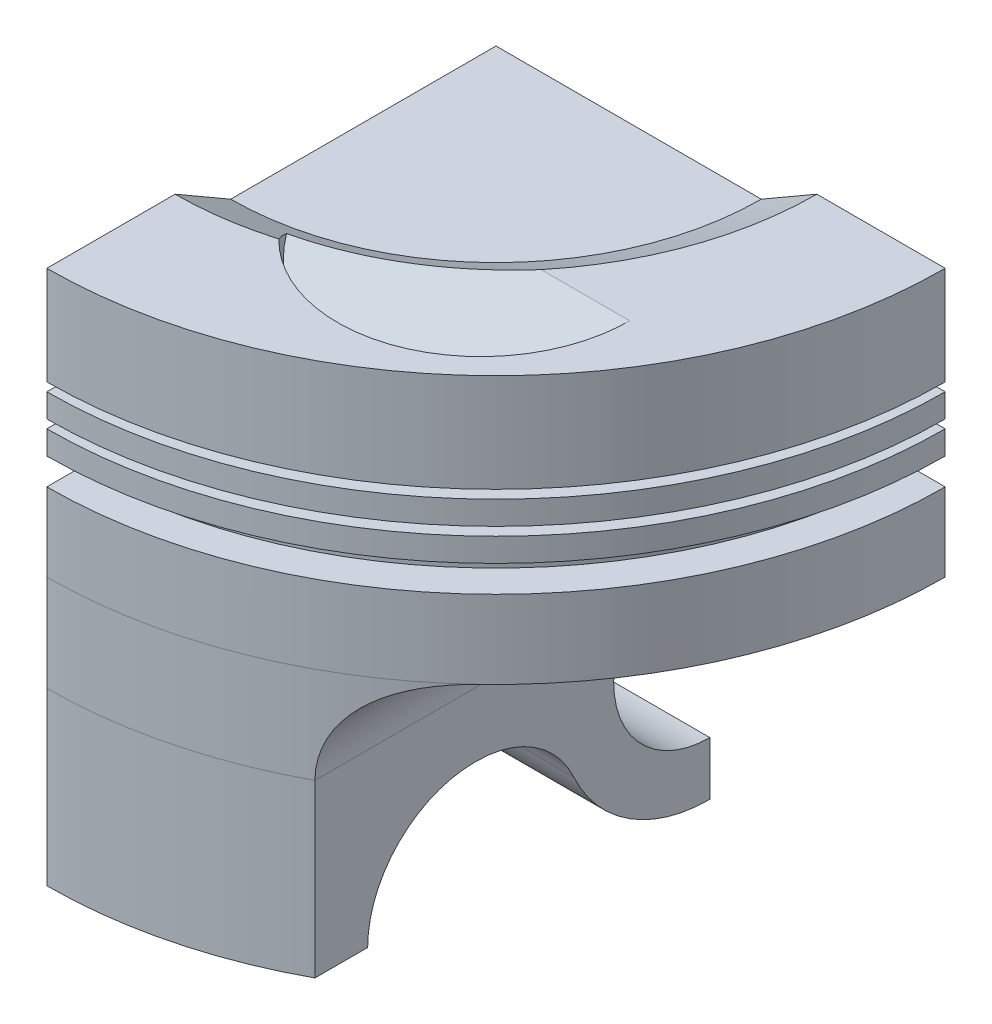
ISO-10303-21;
HEADER;
FILE_DESCRIPTION(('STEP AP214'),'2;1');
FILE_NAME('part.step','',(''),(''),'','','');
FILE_SCHEMA(('AUTOMOTIVE_DESIGN { 1 0 10303 214 1 1 1 1 }'));
ENDSEC;
DATA;
#1=APPLICATION_CONTEXT('core data for automotive mechanical design processes');
#2=APPLICATION_PROTOCOL_DEFINITION('international standard','automotive_design',2000,#1);
#3=PRODUCT_CONTEXT('',#1,'mechanical');
#4=PRODUCT('Part','Part','',(#3));
#5=PRODUCT_RELATED_PRODUCT_CATEGORY('part','',(#4));
#6=PRODUCT_DEFINITION_FORMATION('','',#4);
#7=PRODUCT_DEFINITION_CONTEXT('part definition',#1,'design');
#8=PRODUCT_DEFINITION('design','',#6,#7);
#9=PRODUCT_DEFINITION_SHAPE('','',#8);
#10=(LENGTH_UNIT() NAMED_UNIT(*) SI_UNIT(.MILLI.,.METRE.));
#11=(NAMED_UNIT(*) PLANE_ANGLE_UNIT() SI_UNIT($,.RADIAN.));
#12=(NAMED_UNIT(*) SI_UNIT($,.STERADIAN.) SOLID_ANGLE_UNIT());
#13=UNCERTAINTY_MEASURE_WITH_UNIT(LENGTH_MEASURE(1.E-05),#10,'distance_accuracy_value','');
#14=(GEOMETRIC_REPRESENTATION_CONTEXT(3) GLOBAL_UNCERTAINTY_ASSIGNED_CONTEXT((#13)) GLOBAL_UNIT_ASSIGNED_CONTEXT((#10,
#11,#12)) REPRESENTATION_CONTEXT('',''));
#15=CARTESIAN_POINT('',(0.,0.,0.));
#16=DIRECTION('',(0.,0.,1.));
#17=DIRECTION('',(1.,0.,0.));
#18=AXIS2_PLACEMENT_3D('',#15,#16,#17);
#19=CARTESIAN_POINT('',(0.,-4.00999999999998,0.));
#20=DIRECTION('',(0.,0.,1.));
#21=DIRECTION('',(1.,0.,0.));
#22=AXIS2_PLACEMENT_3D('',#19,#20,#21);
#23=PLANE('',#22);
#24=DIRECTION('',(1.,0.,0.));
#25=VECTOR('',#24,1.);
#26=CARTESIAN_POINT('',(-42.0000000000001,-3.99999999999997,0.));
#27=LINE('',#26,#25);
#28=CARTESIAN_POINT('',(10.,-3.99999999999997,0.));
#29=VERTEX_POINT('',#28);
#30=CARTESIAN_POINT('',(20.,-3.99999999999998,0.));
#31=VERTEX_POINT('',#30);
#32=EDGE_CURVE('E663',#29,#31,#27,.T.);
#33=ORIENTED_EDGE('',*,*,#32,.F.);
#34=DIRECTION('',(0.,1.,0.));
#35=VECTOR('',#34,1.);
#36=CARTESIAN_POINT('',(10.,10.,0.));
#37=LINE('',#36,#35);
#38=CARTESIAN_POINT('',(10.,1.00000000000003,0.));
#39=VERTEX_POINT('',#38);
#40=EDGE_CURVE('E58',#29,#39,#37,.T.);
#41=ORIENTED_EDGE('',*,*,#40,.T.);
#42=DIRECTION('',(1.,0.,0.));
#43=VECTOR('',#42,1.);
#44=CARTESIAN_POINT('',(-42.0000000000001,1.00000000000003,0.));
#45=LINE('',#44,#43);
#46=CARTESIAN_POINT('',(20.,1.00000000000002,0.));
#47=VERTEX_POINT('',#46);
#48=EDGE_CURVE('E667',#47,#39,#45,.F.);
#49=ORIENTED_EDGE('',*,*,#48,.F.);
#50=DIRECTION('',(0.,1.,0.));
#51=VECTOR('',#50,1.);
#52=CARTESIAN_POINT('',(20.,0.,0.));
#53=LINE('',#52,#51);
#54=EDGE_CURVE('E596',#31,#47,#53,.T.);
#55=ORIENTED_EDGE('',*,*,#54,.F.);
#56=EDGE_LOOP('',(#33,#41,#49,#55));
#57=FACE_BOUND('',#56,.T.);
#58=ADVANCED_FACE('F41',(#57),#23,.F.);
#59=CARTESIAN_POINT('',(0.,-4.00999999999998,46.5706581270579));
#60=DIRECTION('',(1.,0.,0.));
#61=DIRECTION('',(0.,0.,-1.));
#62=AXIS2_PLACEMENT_3D('',#59,#60,#61);
#63=PLANE('',#62);
#64=DIRECTION('',(0.,0.,-1.));
#65=VECTOR('',#64,1.);
#66=CARTESIAN_POINT('',(0.,47.,0.));
#67=LINE('',#66,#65);
#68=CARTESIAN_POINT('',(0.,47.,24.8038475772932));
#69=VERTEX_POINT('',#68);
#70=CARTESIAN_POINT('',(0.,47.,0.));
#71=VERTEX_POINT('',#70);
#72=EDGE_CURVE('E45',#69,#71,#67,.T.);
#73=ORIENTED_EDGE('',*,*,#72,.T.);
#74=DIRECTION('',(0.,1.,0.));
#75=VECTOR('',#74,1.);
#76=CARTESIAN_POINT('',(0.,-4.00999999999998,0.));
#77=LINE('',#76,#75);
#78=CARTESIAN_POINT('',(0.,42.,0.));
#79=VERTEX_POINT('',#78);
#80=EDGE_CURVE('E11',#79,#71,#77,.T.);
#81=ORIENTED_EDGE('',*,*,#80,.F.);
#82=DIRECTION('',(0.,0.,-1.));
#83=VECTOR('',#82,1.);
#84=CARTESIAN_POINT('',(0.,42.,0.));
#85=LINE('',#84,#83);
#86=CARTESIAN_POINT('',(0.,42.,26.1435935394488));
#87=VERTEX_POINT('',#86);
#88=EDGE_CURVE('E608',#87,#79,#85,.T.);
#89=ORIENTED_EDGE('',*,*,#88,.F.);
#90=DIRECTION('',(0.,-0.499999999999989,-0.866025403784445));
#91=VECTOR('',#90,1.);
#92=CARTESIAN_POINT('',(0.,26.9059892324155,0.));
#93=LINE('',#92,#91);
#94=CARTESIAN_POINT('',(0.,45.,31.3397459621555));
#95=VERTEX_POINT('',#94);
#96=EDGE_CURVE('E605',#95,#87,#93,.T.);
#97=ORIENTED_EDGE('',*,*,#96,.F.);
#98=DIRECTION('',(0.,0.,-1.));
#99=VECTOR('',#98,1.);
#100=CARTESIAN_POINT('',(0.,45.,0.));
#101=LINE('',#100,#99);
#102=CARTESIAN_POINT('',(0.,45.,34.));
#103=VERTEX_POINT('',#102);
#104=EDGE_CURVE('E591',#103,#95,#101,.T.);
#105=ORIENTED_EDGE('',*,*,#104,.F.);
#106=DIRECTION('',(0.,1.,0.));
#107=VECTOR('',#106,1.);
#108=CARTESIAN_POINT('',(0.,50.,34.));
#109=LINE('',#108,#107);
#110=CARTESIAN_POINT('',(0.,27.3,34.));
#111=VERTEX_POINT('',#110);
#112=EDGE_CURVE('E582',#111,#103,#109,.T.);
#113=ORIENTED_EDGE('',*,*,#112,.F.);
#114=DIRECTION('',(0.,0.,-1.));
#115=VECTOR('',#114,1.);
#116=CARTESIAN_POINT('',(0.,27.3,0.));
#117=LINE('',#116,#115);
#118=CARTESIAN_POINT('',(0.,27.3,37.));
#119=VERTEX_POINT('',#118);
#120=EDGE_CURVE('E668',#119,#111,#117,.T.);
#121=ORIENTED_EDGE('',*,*,#120,.F.);
#122=DIRECTION('',(0.,-1.,0.));
#123=VECTOR('',#122,1.);
#124=CARTESIAN_POINT('',(0.,50.,37.));
#125=LINE('',#124,#123);
#126=CARTESIAN_POINT('',(0.,0.,37.));
#127=VERTEX_POINT('',#126);
#128=EDGE_CURVE('E586',#119,#127,#125,.T.);
#129=ORIENTED_EDGE('',*,*,#128,.T.);
#130=DIRECTION('',(0.,0.,-1.));
#131=VECTOR('',#130,1.);
#132=CARTESIAN_POINT('',(0.,0.,0.));
#133=LINE('',#132,#131);
#134=CARTESIAN_POINT('',(0.,0.,42.));
#135=VERTEX_POINT('',#134);
#136=EDGE_CURVE('E593',#135,#127,#133,.T.);
#137=ORIENTED_EDGE('',*,*,#136,.F.);
#138=DIRECTION('',(0.,-1.,0.));
#139=VECTOR('',#138,1.);
#140=CARTESIAN_POINT('',(0.,50.,42.));
#141=LINE('',#140,#139);
#142=CARTESIAN_POINT('',(0.,16.,42.));
#143=VERTEX_POINT('',#142);
#144=EDGE_CURVE('E597',#143,#135,#141,.T.);
#145=ORIENTED_EDGE('',*,*,#144,.F.);
#146=DIRECTION('',(0.,-1.,0.));
#147=VECTOR('',#146,1.);
#148=CARTESIAN_POINT('',(0.,50.,42.));
#149=LINE('',#148,#147);
#150=CARTESIAN_POINT('',(0.,25.,42.));
#151=VERTEX_POINT('',#150);
#152=EDGE_CURVE('E601',#151,#143,#149,.T.);
#153=ORIENTED_EDGE('',*,*,#152,.F.);
#154=DIRECTION('',(0.,-1.,0.));
#155=VECTOR('',#154,1.);
#156=CARTESIAN_POINT('',(0.,50.,42.));
#157=LINE('',#156,#155);
#158=CARTESIAN_POINT('',(0.,32.3,42.));
#159=VERTEX_POINT('',#158);
#160=EDGE_CURVE('E604',#159,#151,#157,.T.);
#161=ORIENTED_EDGE('',*,*,#160,.F.);
#162=DIRECTION('',(0.,0.,-1.));
#163=VECTOR('',#162,1.);
#164=CARTESIAN_POINT('',(0.,32.3,0.));
#165=LINE('',#164,#163);
#166=CARTESIAN_POINT('',(0.,32.3,39.));
#167=VERTEX_POINT('',#166);
#168=EDGE_CURVE('E611',#159,#167,#165,.T.);
#169=ORIENTED_EDGE('',*,*,#168,.T.);
#170=DIRECTION('',(0.,1.,0.));
#171=VECTOR('',#170,1.);
#172=CARTESIAN_POINT('',(0.,50.,39.));
#173=LINE('',#172,#171);
#174=CARTESIAN_POINT('',(0.,34.8,39.0000000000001));
#175=VERTEX_POINT('',#174);
#176=EDGE_CURVE('E616',#167,#175,#173,.T.);
#177=ORIENTED_EDGE('',*,*,#176,.T.);
#178=DIRECTION('',(0.,0.,1.));
#179=VECTOR('',#178,1.);
#180=CARTESIAN_POINT('',(0.,34.8,0.));
#181=LINE('',#180,#179);
#182=CARTESIAN_POINT('',(0.,34.8,42.0000000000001));
#183=VERTEX_POINT('',#182);
#184=EDGE_CURVE('E620',#175,#183,#181,.T.);
#185=ORIENTED_EDGE('',*,*,#184,.T.);
#186=DIRECTION('',(0.,-1.,0.));
#187=VECTOR('',#186,1.);
#188=CARTESIAN_POINT('',(0.,50.,42.));
#189=LINE('',#188,#187);
#190=CARTESIAN_POINT('',(0.,37.,42.));
#191=VERTEX_POINT('',#190);
#192=EDGE_CURVE('E600',#191,#183,#189,.T.);
#193=ORIENTED_EDGE('',*,*,#192,.F.);
#194=DIRECTION('',(0.,0.,-1.));
#195=VECTOR('',#194,1.);
#196=CARTESIAN_POINT('',(0.,37.,0.));
#197=LINE('',#196,#195);
#198=CARTESIAN_POINT('',(0.,37.,39.));
#199=VERTEX_POINT('',#198);
#200=EDGE_CURVE('E625',#191,#199,#197,.T.);
#201=ORIENTED_EDGE('',*,*,#200,.T.);
#202=DIRECTION('',(0.,1.,0.));
#203=VECTOR('',#202,1.);
#204=CARTESIAN_POINT('',(0.,50.,39.));
#205=LINE('',#204,#203);
#206=CARTESIAN_POINT('',(0.,37.8,39.));
#207=VERTEX_POINT('',#206);
#208=EDGE_CURVE('E630',#199,#207,#205,.T.);
#209=ORIENTED_EDGE('',*,*,#208,.T.);
#210=DIRECTION('',(0.,0.,1.));
#211=VECTOR('',#210,1.);
#212=CARTESIAN_POINT('',(0.,37.8,0.));
#213=LINE('',#212,#211);
#214=CARTESIAN_POINT('',(0.,37.8,42.));
#215=VERTEX_POINT('',#214);
#216=EDGE_CURVE('E634',#207,#215,#213,.T.);
#217=ORIENTED_EDGE('',*,*,#216,.T.);
#218=DIRECTION('',(0.,-1.,0.));
#219=VECTOR('',#218,1.);
#220=CARTESIAN_POINT('',(0.,50.,42.));
#221=LINE('',#220,#219);
#222=CARTESIAN_POINT('',(0.,40.,42.));
#223=VERTEX_POINT('',#222);
#224=EDGE_CURVE('E637',#223,#215,#221,.T.);
#225=ORIENTED_EDGE('',*,*,#224,.F.);
#226=DIRECTION('',(0.,0.,-1.));
#227=VECTOR('',#226,1.);
#228=CARTESIAN_POINT('',(0.,40.,0.));
#229=LINE('',#228,#227);
#230=CARTESIAN_POINT('',(0.,40.,39.));
#231=VERTEX_POINT('',#230);
#232=EDGE_CURVE('E576',#223,#231,#229,.T.);
#233=ORIENTED_EDGE('',*,*,#232,.T.);
#234=DIRECTION('',(0.,1.,0.));
#235=VECTOR('',#234,1.);
#236=CARTESIAN_POINT('',(0.,50.,39.));
#237=LINE('',#236,#235);
#238=CARTESIAN_POINT('',(0.,40.8,39.));
#239=VERTEX_POINT('',#238);
#240=EDGE_CURVE('E643',#231,#239,#237,.T.);
#241=ORIENTED_EDGE('',*,*,#240,.T.);
#242=DIRECTION('',(0.,0.,1.));
#243=VECTOR('',#242,1.);
#244=CARTESIAN_POINT('',(0.,40.8,0.));
#245=LINE('',#244,#243);
#246=CARTESIAN_POINT('',(0.,40.8,42.));
#247=VERTEX_POINT('',#246);
#248=EDGE_CURVE('E647',#239,#247,#245,.T.);
#249=ORIENTED_EDGE('',*,*,#248,.T.);
#250=DIRECTION('',(0.,-1.,0.));
#251=VECTOR('',#250,1.);
#252=CARTESIAN_POINT('',(0.,50.,42.));
#253=LINE('',#252,#251);
#254=CARTESIAN_POINT('',(0.,50.,42.));
#255=VERTEX_POINT('',#254);
#256=EDGE_CURVE('E650',#255,#247,#253,.T.);
#257=ORIENTED_EDGE('',*,*,#256,.F.);
#258=DIRECTION('',(0.,0.,-1.));
#259=VECTOR('',#258,1.);
#260=CARTESIAN_POINT('',(0.,50.,0.));
#261=LINE('',#260,#259);
#262=CARTESIAN_POINT('',(0.,50.,30.));
#263=VERTEX_POINT('',#262);
#264=EDGE_CURVE('E708',#255,#263,#261,.T.);
#265=ORIENTED_EDGE('',*,*,#264,.T.);
#266=DIRECTION('',(0.,-0.499999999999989,-0.866025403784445));
#267=VECTOR('',#266,1.);
#268=CARTESIAN_POINT('',(0.,32.6794919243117,0.));
#269=LINE('',#268,#267);
#270=EDGE_CURVE('E571',#263,#69,#269,.T.);
#271=ORIENTED_EDGE('',*,*,#270,.T.);
#272=EDGE_LOOP('',(#73,#81,#89,#97,#105,#113,#121,#129,#137,#145,#153,#161,#169,#177,#185,#193,
#201,#209,#217,#225,#233,#241,#249,#257,#265,#271));
#273=FACE_BOUND('',#272,.T.);
#274=ADVANCED_FACE('F43',(#273),#63,.F.);
#275=DIRECTION('',(1.,0.,0.));
#276=VECTOR('',#275,1.);
#277=CARTESIAN_POINT('',(0.,47.,0.));
#278=LINE('',#277,#276);
#279=CARTESIAN_POINT('',(24.8038475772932,47.,0.));
#280=VERTEX_POINT('',#279);
#281=EDGE_CURVE('E568',#71,#280,#278,.T.);
#282=ORIENTED_EDGE('',*,*,#281,.T.);
#283=DIRECTION('',(0.866025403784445,0.499999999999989,0.));
#284=VECTOR('',#283,1.);
#285=CARTESIAN_POINT('',(0.,32.6794919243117,0.));
#286=LINE('',#285,#284);
#287=CARTESIAN_POINT('',(30.,50.,0.));
#288=VERTEX_POINT('',#287);
#289=EDGE_CURVE('E574',#280,#288,#286,.T.);
#290=ORIENTED_EDGE('',*,*,#289,.T.);
#291=DIRECTION('',(1.,0.,0.));
#292=VECTOR('',#291,1.);
#293=CARTESIAN_POINT('',(0.,50.,0.));
#294=LINE('',#293,#292);
#295=CARTESIAN_POINT('',(42.,50.,0.));
#296=VERTEX_POINT('',#295);
#297=EDGE_CURVE('E570',#288,#296,#294,.T.);
#298=ORIENTED_EDGE('',*,*,#297,.T.);
#299=DIRECTION('',(0.,-1.,0.));
#300=VECTOR('',#299,1.);
#301=CARTESIAN_POINT('',(42.,50.,0.));
#302=LINE('',#301,#300);
#303=CARTESIAN_POINT('',(42.,40.8,0.));
#304=VERTEX_POINT('',#303);
#305=EDGE_CURVE('E651',#304,#296,#302,.F.);
#306=ORIENTED_EDGE('',*,*,#305,.F.);
#307=DIRECTION('',(-1.,0.,0.));
#308=VECTOR('',#307,1.);
#309=CARTESIAN_POINT('',(42.,40.8,0.));
#310=LINE('',#309,#308);
#311=CARTESIAN_POINT('',(39.,40.8,0.));
#312=VERTEX_POINT('',#311);
#313=EDGE_CURVE('E629',#304,#312,#310,.T.);
#314=ORIENTED_EDGE('',*,*,#313,.T.);
#315=DIRECTION('',(0.,1.,0.));
#316=VECTOR('',#315,1.);
#317=CARTESIAN_POINT('',(39.,50.,0.));
#318=LINE('',#317,#316);
#319=CARTESIAN_POINT('',(39.,40.,0.));
#320=VERTEX_POINT('',#319);
#321=EDGE_CURVE('E646',#312,#320,#318,.F.);
#322=ORIENTED_EDGE('',*,*,#321,.T.);
#323=DIRECTION('',(1.,0.,0.));
#324=VECTOR('',#323,1.);
#325=CARTESIAN_POINT('',(42.,40.,0.));
#326=LINE('',#325,#324);
#327=CARTESIAN_POINT('',(42.,40.,0.));
#328=VERTEX_POINT('',#327);
#329=EDGE_CURVE('E642',#320,#328,#326,.T.);
#330=ORIENTED_EDGE('',*,*,#329,.T.);
#331=DIRECTION('',(0.,-1.,0.));
#332=VECTOR('',#331,1.);
#333=CARTESIAN_POINT('',(42.,50.,0.));
#334=LINE('',#333,#332);
#335=CARTESIAN_POINT('',(42.,37.8,0.));
#336=VERTEX_POINT('',#335);
#337=EDGE_CURVE('E639',#336,#328,#334,.F.);
#338=ORIENTED_EDGE('',*,*,#337,.F.);
#339=DIRECTION('',(-1.,0.,0.));
#340=VECTOR('',#339,1.);
#341=CARTESIAN_POINT('',(42.,37.8,0.));
#342=LINE('',#341,#340);
#343=CARTESIAN_POINT('',(39.,37.8,0.));
#344=VERTEX_POINT('',#343);
#345=EDGE_CURVE('E615',#336,#344,#342,.T.);
#346=ORIENTED_EDGE('',*,*,#345,.T.);
#347=DIRECTION('',(0.,1.,0.));
#348=VECTOR('',#347,1.);
#349=CARTESIAN_POINT('',(39.,50.,0.));
#350=LINE('',#349,#348);
#351=CARTESIAN_POINT('',(39.,37.,0.));
#352=VERTEX_POINT('',#351);
#353=EDGE_CURVE('E633',#344,#352,#350,.F.);
#354=ORIENTED_EDGE('',*,*,#353,.T.);
#355=DIRECTION('',(1.,0.,0.));
#356=VECTOR('',#355,1.);
#357=CARTESIAN_POINT('',(42.,37.,0.));
#358=LINE('',#357,#356);
#359=CARTESIAN_POINT('',(42.,37.,0.));
#360=VERTEX_POINT('',#359);
#361=EDGE_CURVE('E628',#352,#360,#358,.T.);
#362=ORIENTED_EDGE('',*,*,#361,.T.);
#363=DIRECTION('',(0.,-1.,0.));
#364=VECTOR('',#363,1.);
#365=CARTESIAN_POINT('',(42.,50.,0.));
#366=LINE('',#365,#364);
#367=CARTESIAN_POINT('',(42.0000000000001,34.8,0.));
#368=VERTEX_POINT('',#367);
#369=EDGE_CURVE('E624',#368,#360,#366,.F.);
#370=ORIENTED_EDGE('',*,*,#369,.F.);
#371=DIRECTION('',(-1.,0.,0.));
#372=VECTOR('',#371,1.);
#373=CARTESIAN_POINT('',(42.0000000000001,34.8,0.));
#374=LINE('',#373,#372);
#375=CARTESIAN_POINT('',(39.0000000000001,34.8,0.));
#376=VERTEX_POINT('',#375);
#377=EDGE_CURVE('E590',#368,#376,#374,.T.);
#378=ORIENTED_EDGE('',*,*,#377,.T.);
#379=DIRECTION('',(0.,1.,0.));
#380=VECTOR('',#379,1.);
#381=CARTESIAN_POINT('',(39.,50.,0.));
#382=LINE('',#381,#380);
#383=CARTESIAN_POINT('',(39.,32.3,0.));
#384=VERTEX_POINT('',#383);
#385=EDGE_CURVE('E619',#376,#384,#382,.F.);
#386=ORIENTED_EDGE('',*,*,#385,.T.);
#387=DIRECTION('',(1.,0.,0.));
#388=VECTOR('',#387,1.);
#389=CARTESIAN_POINT('',(42.,32.3,0.));
#390=LINE('',#389,#388);
#391=CARTESIAN_POINT('',(42.,32.3,0.));
#392=VERTEX_POINT('',#391);
#393=EDGE_CURVE('E614',#384,#392,#390,.T.);
#394=ORIENTED_EDGE('',*,*,#393,.T.);
#395=DIRECTION('',(0.,-1.,0.));
#396=VECTOR('',#395,1.);
#397=CARTESIAN_POINT('',(42.,50.,0.));
#398=LINE('',#397,#396);
#399=CARTESIAN_POINT('',(42.,25.,0.));
#400=VERTEX_POINT('',#399);
#401=EDGE_CURVE('E599',#400,#392,#398,.F.);
#402=ORIENTED_EDGE('',*,*,#401,.F.);
#403=DIRECTION('',(1.,0.,0.));
#404=VECTOR('',#403,1.);
#405=CARTESIAN_POINT('',(42.,25.,0.));
#406=LINE('',#405,#404);
#407=CARTESIAN_POINT('',(28.4852813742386,25.,0.));
#408=VERTEX_POINT('',#407);
#409=EDGE_CURVE('E656',#408,#400,#406,.T.);
#410=ORIENTED_EDGE('',*,*,#409,.F.);
#411=CARTESIAN_POINT('',(28.4852813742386,16.,0.));
#412=DIRECTION('',(0.,0.,1.));
#413=DIRECTION('',(1.,0.,0.));
#414=AXIS2_PLACEMENT_3D('',#411,#412,#413);
#415=CIRCLE('',#414,9.);
#416=CARTESIAN_POINT('',(20.,19.,0.));
#417=VERTEX_POINT('',#416);
#418=EDGE_CURVE('E683',#417,#408,#415,.F.);
#419=ORIENTED_EDGE('',*,*,#418,.F.);
#420=DIRECTION('',(1.,0.,0.));
#421=VECTOR('',#420,1.);
#422=CARTESIAN_POINT('',(-42.0000000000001,19.,0.));
#423=LINE('',#422,#421);
#424=CARTESIAN_POINT('',(10.,19.,0.));
#425=VERTEX_POINT('',#424);
#426=EDGE_CURVE('E666',#425,#417,#423,.T.);
#427=ORIENTED_EDGE('',*,*,#426,.F.);
#428=CARTESIAN_POINT('',(10.,24.,0.));
#429=VERTEX_POINT('',#428);
#430=EDGE_CURVE('E50',#425,#429,#37,.T.);
#431=ORIENTED_EDGE('',*,*,#430,.T.);
#432=DIRECTION('',(1.,0.,0.));
#433=VECTOR('',#432,1.);
#434=CARTESIAN_POINT('',(-42.0000000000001,24.,0.));
#435=LINE('',#434,#433);
#436=CARTESIAN_POINT('',(15.,24.,0.));
#437=VERTEX_POINT('',#436);
#438=EDGE_CURVE('E66',#437,#429,#435,.F.);
#439=ORIENTED_EDGE('',*,*,#438,.F.);
#440=DIRECTION('',(0.,1.,0.));
#441=VECTOR('',#440,1.);
#442=CARTESIAN_POINT('',(15.,0.,0.));
#443=LINE('',#442,#441);
#444=CARTESIAN_POINT('',(15.,30.,0.));
#445=VERTEX_POINT('',#444);
#446=EDGE_CURVE('E603',#437,#445,#443,.T.);
#447=ORIENTED_EDGE('',*,*,#446,.T.);
#448=DIRECTION('',(1.,0.,0.));
#449=VECTOR('',#448,1.);
#450=CARTESIAN_POINT('',(42.,30.,0.));
#451=LINE('',#450,#449);
#452=CARTESIAN_POINT('',(34.,30.,0.));
#453=VERTEX_POINT('',#452);
#454=EDGE_CURVE('E589',#445,#453,#451,.T.);
#455=ORIENTED_EDGE('',*,*,#454,.T.);
#456=DIRECTION('',(0.,1.,0.));
#457=VECTOR('',#456,1.);
#458=CARTESIAN_POINT('',(34.,50.,0.));
#459=LINE('',#458,#457);
#460=CARTESIAN_POINT('',(34.,45.,0.));
#461=VERTEX_POINT('',#460);
#462=EDGE_CURVE('E585',#461,#453,#459,.F.);
#463=ORIENTED_EDGE('',*,*,#462,.F.);
#464=DIRECTION('',(1.,0.,0.));
#465=VECTOR('',#464,1.);
#466=CARTESIAN_POINT('',(0.,45.,0.));
#467=LINE('',#466,#465);
#468=CARTESIAN_POINT('',(31.3397459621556,45.,0.));
#469=VERTEX_POINT('',#468);
#470=EDGE_CURVE('E594',#469,#461,#467,.T.);
#471=ORIENTED_EDGE('',*,*,#470,.F.);
#472=DIRECTION('',(0.866025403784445,0.499999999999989,0.));
#473=VECTOR('',#472,1.);
#474=CARTESIAN_POINT('',(0.,26.9059892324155,0.));
#475=LINE('',#474,#473);
#476=CARTESIAN_POINT('',(26.1435935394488,42.,0.));
#477=VERTEX_POINT('',#476);
#478=EDGE_CURVE('E584',#477,#469,#475,.T.);
#479=ORIENTED_EDGE('',*,*,#478,.F.);
#480=DIRECTION('',(1.,0.,0.));
#481=VECTOR('',#480,1.);
#482=CARTESIAN_POINT('',(0.,42.,0.));
#483=LINE('',#482,#481);
#484=EDGE_CURVE('E607',#79,#477,#483,.T.);
#485=ORIENTED_EDGE('',*,*,#484,.F.);
#486=ORIENTED_EDGE('',*,*,#80,.T.);
#487=EDGE_LOOP('',(#282,#290,#298,#306,#314,#322,#330,#338,#346,#354,#362,#370,#378,#386,#394,
#402,#410,#419,#427,#431,#439,#447,#455,#463,#471,#479,#485,#486));
#488=FACE_BOUND('',#487,.T.);
#489=ADVANCED_FACE('F512',(#488),#23,.F.);
#490=CARTESIAN_POINT('',(0.,50.,0.));
#491=DIRECTION('',(0.,-1.,0.));
#492=DIRECTION('',(0.,0.,-1.));
#493=AXIS2_PLACEMENT_3D('',#490,#491,#492);
#494=CYLINDRICAL_SURFACE('',#493,42.);
#495=CARTESIAN_POINT('',(0.,25.,0.));
#496=DIRECTION('',(0.,-1.,0.));
#497=DIRECTION('',(0.,0.,-1.));
#498=AXIS2_PLACEMENT_3D('',#495,#496,#497);
#499=CIRCLE('',#498,42.);
#500=CARTESIAN_POINT('',(29.,25.,30.3809150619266));
#501=VERTEX_POINT('',#500);
#502=EDGE_CURVE('E692',#501,#151,#499,.T.);
#503=ORIENTED_EDGE('',*,*,#502,.T.);
#504=ORIENTED_EDGE('',*,*,#152,.T.);
#505=CARTESIAN_POINT('',(0.,16.,0.));
#506=DIRECTION('',(0.,-1.,0.));
#507=DIRECTION('',(0.,0.,-1.));
#508=AXIS2_PLACEMENT_3D('',#505,#506,#507);
#509=CIRCLE('',#508,42.);
#510=CARTESIAN_POINT('',(20.,16.,36.9323706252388));
#511=VERTEX_POINT('',#510);
#512=EDGE_CURVE('E696',#511,#143,#509,.T.);
#513=ORIENTED_EDGE('',*,*,#512,.F.);
#514=CARTESIAN_POINT('',(20.,16.,36.9323706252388));
#515=CARTESIAN_POINT('',(19.9999613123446,16.2280744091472,36.9323749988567));
#516=CARTESIAN_POINT('',(20.0086679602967,16.4561392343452,36.9276761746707));
#517=CARTESIAN_POINT('',(20.0432898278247,16.9105285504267,36.9089047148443));
#518=CARTESIAN_POINT('',(20.0692017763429,17.1368533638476,36.894833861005));
#519=CARTESIAN_POINT('',(20.1378495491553,17.5854577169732,36.8574069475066));
#520=CARTESIAN_POINT('',(20.1805348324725,17.8077473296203,36.8340787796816));
#521=CARTESIAN_POINT('',(20.2821936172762,18.247386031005,36.7782001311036));
#522=CARTESIAN_POINT('',(20.3411673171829,18.4647350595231,36.7456495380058));
#523=CARTESIAN_POINT('',(20.4746717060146,18.8929334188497,36.6714280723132));
#524=CARTESIAN_POINT('',(20.5491984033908,19.1037844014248,36.6297595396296));
#525=CARTESIAN_POINT('',(20.7129315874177,19.5176737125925,36.5374231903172));
#526=CARTESIAN_POINT('',(20.8021387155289,19.7207116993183,36.4867549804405));
#527=CARTESIAN_POINT('',(20.9942276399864,20.1177994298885,36.3765674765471));
#528=CARTESIAN_POINT('',(21.097114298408,20.3118459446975,36.3170450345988));
#529=CARTESIAN_POINT('',(21.3153791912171,20.6898006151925,36.1893712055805));
#530=CARTESIAN_POINT('',(21.4307576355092,20.8737086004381,36.121219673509));
#531=CARTESIAN_POINT('',(21.6763725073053,21.2358150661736,35.9743789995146));
#532=CARTESIAN_POINT('',(21.8069495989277,21.4136793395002,35.895436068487));
#533=CARTESIAN_POINT('',(22.0786056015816,21.756927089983,35.7289874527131));
#534=CARTESIAN_POINT('',(22.2196846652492,21.9223103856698,35.6414816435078));
#535=CARTESIAN_POINT('',(22.5108464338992,22.239975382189,35.4583044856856));
#536=CARTESIAN_POINT('',(22.6609259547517,22.3922616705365,35.3626360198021));
#537=CARTESIAN_POINT('',(22.9687148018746,22.6834491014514,35.1635001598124));
#538=CARTESIAN_POINT('',(23.1264250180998,22.82234867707,35.0600318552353));
#539=CARTESIAN_POINT('',(23.4643422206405,23.0999302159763,34.8348948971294));
#540=CARTESIAN_POINT('',(23.645211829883,23.2371710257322,34.7124437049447));
#541=CARTESIAN_POINT('',(24.0127553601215,23.4951864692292,34.4592135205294));
#542=CARTESIAN_POINT('',(24.1994296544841,23.6159600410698,34.3284339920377));
#543=CARTESIAN_POINT('',(24.5774120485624,23.8415090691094,34.0588434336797));
#544=CARTESIAN_POINT('',(24.7687300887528,23.9462459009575,33.9200140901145));
#545=CARTESIAN_POINT('',(25.1541180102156,24.1397609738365,33.6352169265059));
#546=CARTESIAN_POINT('',(25.3481883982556,24.2285362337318,33.4892477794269));
#547=CARTESIAN_POINT('',(25.8341817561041,24.4307194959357,33.1169049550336));
#548=CARTESIAN_POINT('',(26.1270123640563,24.5345837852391,32.8864816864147));
#549=CARTESIAN_POINT('',(26.7123341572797,24.7097676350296,32.4128556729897));
#550=CARTESIAN_POINT('',(27.0048248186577,24.7810585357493,32.1696418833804));
#551=CARTESIAN_POINT('',(27.5848042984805,24.8929159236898,31.6737007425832));
#552=CARTESIAN_POINT('',(27.8723115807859,24.9336459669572,31.4210317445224));
#553=CARTESIAN_POINT('',(28.2990151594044,24.9737948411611,31.0355035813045));
#554=CARTESIAN_POINT('',(28.4403766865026,24.9836872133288,30.9060150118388));
#555=CARTESIAN_POINT('',(28.7214587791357,24.9967877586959,30.6449765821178));
#556=CARTESIAN_POINT('',(28.8611795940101,24.9999969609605,30.5134270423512));
#557=CARTESIAN_POINT('',(29.,25.,30.3809150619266));
#558=B_SPLINE_CURVE_WITH_KNOTS('',3,(#514,#515,#516,#517,#518,#519,#520,#521,#522,#523,#524,
#525,#526,#527,#528,#529,#530,#531,#532,#533,#534,#535,#536,#537,#538,#539,#540,#541,#542,#543,
#544,#545,#546,#547,#548,#549,#550,#551,#552,#553,#554,#555,#556,#557),.UNSPECIFIED.,.F.,.F.,(4,
2,2,2,2,2,2,2,2,2,2,2,2,2,2,2,2,2,2,2,2,4),(0.,0.68399414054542,1.3678582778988,
2.04967742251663,2.73150487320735,3.41315755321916,4.09484002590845,4.77676543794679,
5.4587023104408,6.16099141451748,6.86329072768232,7.56534303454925,8.26747741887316,
9.04058347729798,9.81373936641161,10.5887290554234,11.3638633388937,12.5225023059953,
13.6821587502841,14.8355637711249,15.4113278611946,15.9870032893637),.UNSPECIFIED.);
#559=EDGE_CURVE('E501',#511,#501,#558,.T.);
#560=ORIENTED_EDGE('',*,*,#559,.T.);
#561=EDGE_LOOP('',(#503,#504,#513,#560));
#562=FACE_BOUND('',#561,.T.);
#563=ADVANCED_FACE('F507',(#562),#494,.T.);
#564=CARTESIAN_POINT('',(0.,32.3,0.));
#565=DIRECTION('',(0.,1.,0.));
#566=DIRECTION('',(-1.,0.,0.));
#567=AXIS2_PLACEMENT_3D('',#564,#565,#566);
#568=CIRCLE('',#567,42.);
#569=EDGE_CURVE('E382',#159,#392,#568,.T.);
#570=ORIENTED_EDGE('',*,*,#569,.F.);
#571=ORIENTED_EDGE('',*,*,#160,.T.);
#572=ORIENTED_EDGE('',*,*,#502,.F.);
#573=CARTESIAN_POINT('',(0.,25.,0.));
#574=DIRECTION('',(0.,1.,0.));
#575=DIRECTION('',(-1.,0.,0.));
#576=AXIS2_PLACEMENT_3D('',#573,#574,#575);
#577=CIRCLE('',#576,42.);
#578=EDGE_CURVE('E425',#501,#400,#577,.T.);
#579=ORIENTED_EDGE('',*,*,#578,.T.);
#580=ORIENTED_EDGE('',*,*,#401,.T.);
#581=EDGE_LOOP('',(#570,#571,#572,#579,#580));
#582=FACE_BOUND('',#581,.T.);
#583=ADVANCED_FACE('F511',(#582),#494,.T.);
#584=CARTESIAN_POINT('',(-42.0000000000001,10.,14.));
#585=DIRECTION('',(0.,1.,0.));
#586=DIRECTION('',(0.,0.,1.));
#587=AXIS2_PLACEMENT_3D('',#584,#585,#586);
#588=PLANE('',#587);
#589=DIRECTION('',(0.,0.,-1.));
#590=VECTOR('',#589,1.);
#591=CARTESIAN_POINT('',(20.,10.,-42.));
#592=LINE('',#591,#590);
#593=CARTESIAN_POINT('',(20.,10.,22.));
#594=VERTEX_POINT('',#593);
#595=CARTESIAN_POINT('',(20.,10.,21.8174242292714));
#596=VERTEX_POINT('',#595);
#597=EDGE_CURVE('E327',#594,#596,#592,.T.);
#598=ORIENTED_EDGE('',*,*,#597,.F.);
#599=DIRECTION('',(1.,0.,0.));
#600=VECTOR('',#599,1.);
#601=CARTESIAN_POINT('',(15.,10.,22.));
#602=LINE('',#601,#600);
#603=CARTESIAN_POINT('',(15.,10.,22.));
#604=VERTEX_POINT('',#603);
#605=EDGE_CURVE('E434',#594,#604,#602,.F.);
#606=ORIENTED_EDGE('',*,*,#605,.T.);
#607=DIRECTION('',(0.,0.,-1.));
#608=VECTOR('',#607,1.);
#609=CARTESIAN_POINT('',(15.,10.,-42.));
#610=LINE('',#609,#608);
#611=CARTESIAN_POINT('',(15.,10.,21.8174242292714));
#612=VERTEX_POINT('',#611);
#613=EDGE_CURVE('E428',#604,#612,#610,.T.);
#614=ORIENTED_EDGE('',*,*,#613,.T.);
#615=DIRECTION('',(-1.,0.,0.));
#616=VECTOR('',#615,1.);
#617=CARTESIAN_POINT('',(20.,10.,21.8174242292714));
#618=LINE('',#617,#616);
#619=EDGE_CURVE('E431',#612,#596,#618,.F.);
#620=ORIENTED_EDGE('',*,*,#619,.T.);
#621=EDGE_LOOP('',(#598,#606,#614,#620));
#622=FACE_BOUND('',#621,.T.);
#623=ADVANCED_FACE('F520',(#622),#588,.F.);
#624=CARTESIAN_POINT('',(-42.0000000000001,0.,22.));
#625=DIRECTION('',(-1.,0.,0.));
#626=DIRECTION('',(0.,0.,1.));
#627=AXIS2_PLACEMENT_3D('',#624,#625,#626);
#628=CYLINDRICAL_SURFACE('',#627,10.);
#629=CARTESIAN_POINT('',(15.,0.,22.));
#630=DIRECTION('',(-1.,0.,0.));
#631=DIRECTION('',(0.,-1.,0.));
#632=AXIS2_PLACEMENT_3D('',#629,#630,#631);
#633=CIRCLE('',#632,10.);
#634=CARTESIAN_POINT('',(15.,0.,32.));
#635=VERTEX_POINT('',#634);
#636=EDGE_CURVE('E441',#604,#635,#633,.F.);
#637=ORIENTED_EDGE('',*,*,#636,.F.);
#638=ORIENTED_EDGE('',*,*,#605,.F.);
#639=CARTESIAN_POINT('',(20.,0.,22.));
#640=DIRECTION('',(-1.,0.,0.));
#641=DIRECTION('',(0.,-1.,0.));
#642=AXIS2_PLACEMENT_3D('',#639,#640,#641);
#643=CIRCLE('',#642,10.);
#644=CARTESIAN_POINT('',(20.,0.,32.));
#645=VERTEX_POINT('',#644);
#646=EDGE_CURVE('E439',#645,#594,#643,.T.);
#647=ORIENTED_EDGE('',*,*,#646,.F.);
#648=DIRECTION('',(1.,0.,0.));
#649=VECTOR('',#648,1.);
#650=CARTESIAN_POINT('',(0.,0.,32.));
#651=LINE('',#650,#649);
#652=EDGE_CURVE('E331',#635,#645,#651,.T.);
#653=ORIENTED_EDGE('',*,*,#652,.F.);
#654=EDGE_LOOP('',(#637,#638,#647,#653));
#655=FACE_BOUND('',#654,.T.);
#656=ADVANCED_FACE('F517',(#655),#628,.F.);
#657=ORIENTED_EDGE('',*,*,#512,.T.);
#658=ORIENTED_EDGE('',*,*,#144,.T.);
#659=CARTESIAN_POINT('',(0.,0.,0.));
#660=DIRECTION('',(0.,1.,0.));
#661=DIRECTION('',(0.,0.,1.));
#662=AXIS2_PLACEMENT_3D('',#659,#660,#661);
#663=CIRCLE('',#662,42.);
#664=CARTESIAN_POINT('',(20.,0.,36.9323706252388));
#665=VERTEX_POINT('',#664);
#666=EDGE_CURVE('E417',#135,#665,#663,.T.);
#667=ORIENTED_EDGE('',*,*,#666,.T.);
#668=DIRECTION('',(0.,-1.,0.));
#669=VECTOR('',#668,1.);
#670=CARTESIAN_POINT('',(20.,50.,36.9323706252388));
#671=LINE('',#670,#669);
#672=EDGE_CURVE('E409',#665,#511,#671,.F.);
#673=ORIENTED_EDGE('',*,*,#672,.T.);
#674=EDGE_LOOP('',(#657,#658,#667,#673));
#675=FACE_BOUND('',#674,.T.);
#676=ADVANCED_FACE('F519',(#675),#494,.T.);
#677=CARTESIAN_POINT('',(0.,0.,0.));
#678=DIRECTION('',(0.,1.,0.));
#679=DIRECTION('',(0.,0.,1.));
#680=AXIS2_PLACEMENT_3D('',#677,#678,#679);
#681=PLANE('',#680);
#682=ORIENTED_EDGE('',*,*,#666,.F.);
#683=ORIENTED_EDGE('',*,*,#136,.T.);
#684=CARTESIAN_POINT('',(0.,0.,0.));
#685=DIRECTION('',(0.,1.,0.));
#686=DIRECTION('',(0.,0.,1.));
#687=AXIS2_PLACEMENT_3D('',#684,#685,#686);
#688=CIRCLE('',#687,37.);
#689=CARTESIAN_POINT('',(15.,0.,33.8230690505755));
#690=VERTEX_POINT('',#689);
#691=EDGE_CURVE('E349',#127,#690,#688,.T.);
#692=ORIENTED_EDGE('',*,*,#691,.T.);
#693=DIRECTION('',(0.,0.,1.));
#694=VECTOR('',#693,1.);
#695=CARTESIAN_POINT('',(15.,0.,0.));
#696=LINE('',#695,#694);
#697=EDGE_CURVE('E358',#635,#690,#696,.T.);
#698=ORIENTED_EDGE('',*,*,#697,.F.);
#699=ORIENTED_EDGE('',*,*,#652,.T.);
#700=DIRECTION('',(0.,0.,1.));
#701=VECTOR('',#700,1.);
#702=CARTESIAN_POINT('',(20.,0.,0.));
#703=LINE('',#702,#701);
#704=EDGE_CURVE('E421',#645,#665,#703,.T.);
#705=ORIENTED_EDGE('',*,*,#704,.T.);
#706=EDGE_LOOP('',(#682,#683,#692,#698,#699,#705));
#707=FACE_BOUND('',#706,.T.);
#708=ADVANCED_FACE('F515',(#707),#681,.F.);
#709=CARTESIAN_POINT('',(0.,42.,0.));
#710=DIRECTION('',(0.,1.,0.));
#711=DIRECTION('',(-1.,0.,0.));
#712=AXIS2_PLACEMENT_3D('',#709,#710,#711);
#713=PLANE('',#712);
#714=CARTESIAN_POINT('',(0.,42.,0.));
#715=DIRECTION('',(0.,1.,0.));
#716=DIRECTION('',(-1.,0.,0.));
#717=AXIS2_PLACEMENT_3D('',#714,#715,#716);
#718=CIRCLE('',#717,26.1435935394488);
#719=EDGE_CURVE('E345',#87,#477,#718,.T.);
#720=ORIENTED_EDGE('',*,*,#719,.F.);
#721=ORIENTED_EDGE('',*,*,#88,.T.);
#722=ORIENTED_EDGE('',*,*,#484,.T.);
#723=EDGE_LOOP('',(#720,#721,#722));
#724=FACE_BOUND('',#723,.T.);
#725=ADVANCED_FACE('F971',(#724),#713,.F.);
#726=CARTESIAN_POINT('',(0.,45.,0.));
#727=DIRECTION('',(0.,1.,0.));
#728=DIRECTION('',(0.,0.,1.));
#729=AXIS2_PLACEMENT_3D('',#726,#727,#728);
#730=PLANE('',#729);
#731=CARTESIAN_POINT('',(0.,45.,0.));
#732=DIRECTION('',(0.,1.,0.));
#733=DIRECTION('',(0.,0.,1.));
#734=AXIS2_PLACEMENT_3D('',#731,#732,#733);
#735=CIRCLE('',#734,34.);
#736=EDGE_CURVE('E370',#103,#461,#735,.T.);
#737=ORIENTED_EDGE('',*,*,#736,.F.);
#738=ORIENTED_EDGE('',*,*,#104,.T.);
#739=CARTESIAN_POINT('',(0.,45.,0.));
#740=DIRECTION('',(0.,1.,0.));
#741=DIRECTION('',(0.,0.,1.));
#742=AXIS2_PLACEMENT_3D('',#739,#740,#741);
#743=CIRCLE('',#742,31.3397459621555);
#744=EDGE_CURVE('E342',#95,#469,#743,.T.);
#745=ORIENTED_EDGE('',*,*,#744,.T.);
#746=ORIENTED_EDGE('',*,*,#470,.T.);
#747=EDGE_LOOP('',(#737,#738,#745,#746));
#748=FACE_BOUND('',#747,.T.);
#749=ADVANCED_FACE('F809',(#748),#730,.F.);
#750=CARTESIAN_POINT('',(0.,50.,0.));
#751=DIRECTION('',(0.,1.,0.));
#752=DIRECTION('',(-1.,0.,0.));
#753=AXIS2_PLACEMENT_3D('',#750,#751,#752);
#754=CYLINDRICAL_SURFACE('',#753,34.);
#755=CARTESIAN_POINT('',(0.,27.3,0.));
#756=DIRECTION('',(0.,1.,0.));
#757=DIRECTION('',(-1.,0.,0.));
#758=AXIS2_PLACEMENT_3D('',#755,#756,#757);
#759=CIRCLE('',#758,34.);
#760=CARTESIAN_POINT('',(15.,27.3,30.5122926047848));
#761=VERTEX_POINT('',#760);
#762=EDGE_CURVE('E341',#111,#761,#759,.T.);
#763=ORIENTED_EDGE('',*,*,#762,.F.);
#764=ORIENTED_EDGE('',*,*,#112,.T.);
#765=ORIENTED_EDGE('',*,*,#736,.T.);
#766=ORIENTED_EDGE('',*,*,#462,.T.);
#767=CARTESIAN_POINT('',(0.,30.,0.));
#768=DIRECTION('',(0.,1.,0.));
#769=DIRECTION('',(-1.,0.,0.));
#770=AXIS2_PLACEMENT_3D('',#767,#768,#769);
#771=CIRCLE('',#770,34.);
#772=CARTESIAN_POINT('',(15.,30.,30.5122926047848));
#773=VERTEX_POINT('',#772);
#774=EDGE_CURVE('E367',#773,#453,#771,.T.);
#775=ORIENTED_EDGE('',*,*,#774,.F.);
#776=DIRECTION('',(0.,1.,0.));
#777=VECTOR('',#776,1.);
#778=CARTESIAN_POINT('',(15.,50.,30.5122926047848));
#779=LINE('',#778,#777);
#780=EDGE_CURVE('E364',#773,#761,#779,.F.);
#781=ORIENTED_EDGE('',*,*,#780,.T.);
#782=EDGE_LOOP('',(#763,#764,#765,#766,#775,#781));
#783=FACE_BOUND('',#782,.T.);
#784=ADVANCED_FACE('F794',(#783),#754,.F.);
#785=CARTESIAN_POINT('',(15.,0.,-42.));
#786=DIRECTION('',(-1.,0.,0.));
#787=DIRECTION('',(0.,-1.,0.));
#788=AXIS2_PLACEMENT_3D('',#785,#786,#787);
#789=PLANE('',#788);
#790=ORIENTED_EDGE('',*,*,#446,.F.);
#791=CARTESIAN_POINT('',(15.,10.,0.));
#792=DIRECTION('',(-1.,0.,0.));
#793=DIRECTION('',(0.,-1.,0.));
#794=AXIS2_PLACEMENT_3D('',#791,#792,#793);
#795=CIRCLE('',#794,14.);
#796=CARTESIAN_POINT('',(15.,4.16666666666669,12.7268308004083));
#797=VERTEX_POINT('',#796);
#798=EDGE_CURVE('E324',#797,#437,#795,.T.);
#799=ORIENTED_EDGE('',*,*,#798,.F.);
#800=CARTESIAN_POINT('',(15.,0.,21.8174242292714));
#801=DIRECTION('',(-1.,0.,0.));
#802=DIRECTION('',(0.,-1.,0.));
#803=AXIS2_PLACEMENT_3D('',#800,#801,#802);
#804=CIRCLE('',#803,10.);
#805=EDGE_CURVE('E445',#797,#612,#804,.F.);
#806=ORIENTED_EDGE('',*,*,#805,.T.);
#807=ORIENTED_EDGE('',*,*,#613,.F.);
#808=ORIENTED_EDGE('',*,*,#636,.T.);
#809=ORIENTED_EDGE('',*,*,#697,.T.);
#810=DIRECTION('',(0.,-1.,0.));
#811=VECTOR('',#810,1.);
#812=CARTESIAN_POINT('',(15.,0.,33.8230690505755));
#813=LINE('',#812,#811);
#814=CARTESIAN_POINT('',(15.,27.3,33.8230690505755));
#815=VERTEX_POINT('',#814);
#816=EDGE_CURVE('E346',#690,#815,#813,.F.);
#817=ORIENTED_EDGE('',*,*,#816,.T.);
#818=DIRECTION('',(0.,0.,1.));
#819=VECTOR('',#818,1.);
#820=CARTESIAN_POINT('',(15.,27.3,0.));
#821=LINE('',#820,#819);
#822=EDGE_CURVE('E361',#761,#815,#821,.T.);
#823=ORIENTED_EDGE('',*,*,#822,.F.);
#824=ORIENTED_EDGE('',*,*,#780,.F.);
#825=DIRECTION('',(0.,0.,1.));
#826=VECTOR('',#825,1.);
#827=CARTESIAN_POINT('',(15.,30.,-42.));
#828=LINE('',#827,#826);
#829=EDGE_CURVE('E353',#445,#773,#828,.T.);
#830=ORIENTED_EDGE('',*,*,#829,.F.);
#831=EDGE_LOOP('',(#790,#799,#806,#807,#808,#809,#817,#823,#824,#830));
#832=FACE_BOUND('',#831,.T.);
#833=ADVANCED_FACE('F780',(#832),#789,.T.);
#834=CARTESIAN_POINT('',(-42.0000000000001,0.,21.8174242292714));
#835=DIRECTION('',(1.,0.,0.));
#836=DIRECTION('',(0.,0.,-1.));
#837=AXIS2_PLACEMENT_3D('',#834,#835,#836);
#838=CYLINDRICAL_SURFACE('',#837,10.);
#839=ORIENTED_EDGE('',*,*,#805,.F.);
#840=DIRECTION('',(1.,0.,0.));
#841=VECTOR('',#840,1.);
#842=CARTESIAN_POINT('',(-42.0000000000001,4.16666666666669,12.7268308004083));
#843=LINE('',#842,#841);
#844=CARTESIAN_POINT('',(20.,4.16666666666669,12.7268308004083));
#845=VERTEX_POINT('',#844);
#846=EDGE_CURVE('E436',#845,#797,#843,.F.);
#847=ORIENTED_EDGE('',*,*,#846,.F.);
#848=CARTESIAN_POINT('',(20.,0.,21.8174242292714));
#849=DIRECTION('',(-1.,0.,0.));
#850=DIRECTION('',(0.,-1.,0.));
#851=AXIS2_PLACEMENT_3D('',#848,#849,#850);
#852=CIRCLE('',#851,10.);
#853=EDGE_CURVE('E443',#596,#845,#852,.T.);
#854=ORIENTED_EDGE('',*,*,#853,.F.);
#855=ORIENTED_EDGE('',*,*,#619,.F.);
#856=EDGE_LOOP('',(#839,#847,#854,#855));
#857=FACE_BOUND('',#856,.T.);
#858=ADVANCED_FACE('F467',(#857),#838,.F.);
#859=CARTESIAN_POINT('',(20.,0.,-42.));
#860=DIRECTION('',(-1.,0.,0.));
#861=DIRECTION('',(0.,-1.,0.));
#862=AXIS2_PLACEMENT_3D('',#859,#860,#861);
#863=PLANE('',#862);
#864=CARTESIAN_POINT('',(20.,10.,0.));
#865=DIRECTION('',(-1.,0.,0.));
#866=DIRECTION('',(0.,-1.,0.));
#867=AXIS2_PLACEMENT_3D('',#864,#865,#866);
#868=CIRCLE('',#867,14.);
#869=EDGE_CURVE('E334',#845,#31,#868,.F.);
#870=ORIENTED_EDGE('',*,*,#869,.T.);
#871=ORIENTED_EDGE('',*,*,#54,.T.);
#872=CARTESIAN_POINT('',(20.,10.,0.));
#873=DIRECTION('',(-1.,0.,0.));
#874=DIRECTION('',(0.,-1.,0.));
#875=AXIS2_PLACEMENT_3D('',#872,#873,#874);
#876=CIRCLE('',#875,9.);
#877=CARTESIAN_POINT('',(20.,16.,6.70820393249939));
#878=VERTEX_POINT('',#877);
#879=EDGE_CURVE('E337',#47,#878,#876,.T.);
#880=ORIENTED_EDGE('',*,*,#879,.T.);
#881=DIRECTION('',(0.,0.,1.));
#882=VECTOR('',#881,1.);
#883=CARTESIAN_POINT('',(20.,16.,36.9323706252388));
#884=LINE('',#883,#882);
#885=EDGE_CURVE('E447',#878,#511,#884,.T.);
#886=ORIENTED_EDGE('',*,*,#885,.T.);
#887=ORIENTED_EDGE('',*,*,#672,.F.);
#888=ORIENTED_EDGE('',*,*,#704,.F.);
#889=ORIENTED_EDGE('',*,*,#646,.T.);
#890=ORIENTED_EDGE('',*,*,#597,.T.);
#891=ORIENTED_EDGE('',*,*,#853,.T.);
#892=EDGE_LOOP('',(#870,#871,#880,#886,#887,#888,#889,#890,#891));
#893=FACE_BOUND('',#892,.T.);
#894=ADVANCED_FACE('F499',(#893),#863,.F.);
#895=CARTESIAN_POINT('',(29.,16.,-42.));
#896=DIRECTION('',(0.,0.,-1.));
#897=DIRECTION('',(-1.,0.,0.));
#898=AXIS2_PLACEMENT_3D('',#895,#896,#897);
#899=CYLINDRICAL_SURFACE('',#898,9.);
#900=ORIENTED_EDGE('',*,*,#559,.F.);
#901=ORIENTED_EDGE('',*,*,#885,.F.);
#902=CARTESIAN_POINT('',(29.,16.,6.70820393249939));
#903=DIRECTION('',(0.,0.,1.));
#904=DIRECTION('',(1.,0.,0.));
#905=AXIS2_PLACEMENT_3D('',#902,#903,#904);
#906=CIRCLE('',#905,9.);
#907=CARTESIAN_POINT('',(29.,25.,6.7082039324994));
#908=VERTEX_POINT('',#907);
#909=EDGE_CURVE('E316',#908,#878,#906,.T.);
#910=ORIENTED_EDGE('',*,*,#909,.F.);
#911=DIRECTION('',(0.,0.,1.));
#912=VECTOR('',#911,1.);
#913=CARTESIAN_POINT('',(29.,25.,-36.9323706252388));
#914=LINE('',#913,#912);
#915=EDGE_CURVE('E458',#501,#908,#914,.F.);
#916=ORIENTED_EDGE('',*,*,#915,.F.);
#917=EDGE_LOOP('',(#900,#901,#910,#916));
#918=FACE_BOUND('',#917,.T.);
#919=ADVANCED_FACE('F496',(#918),#899,.F.);
#920=CARTESIAN_POINT('',(42.,25.,-42.));
#921=DIRECTION('',(0.,1.,0.));
#922=DIRECTION('',(-1.,0.,0.));
#923=AXIS2_PLACEMENT_3D('',#920,#921,#922);
#924=PLANE('',#923);
#925=CARTESIAN_POINT('',(20.,14.5805560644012,-7.74716116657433));
#926=CARTESIAN_POINT('',(18.3977249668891,25.,-7.29763004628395));
#927=CARTESIAN_POINT('',(28.5569675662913,25.,-10.1478870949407));
#928=CARTESIAN_POINT('',(20.,14.6380701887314,-7.71313529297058));
#929=CARTESIAN_POINT('',(18.4654993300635,25.,-7.31102755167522));
#930=CARTESIAN_POINT('',(28.6052277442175,25.,-9.97590745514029));
#931=CARTESIAN_POINT('',(20.,14.6977768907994,-7.67698779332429));
#932=CARTESIAN_POINT('',(18.5367963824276,25.,-7.31878772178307));
#933=CARTESIAN_POINT('',(28.6492310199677,25.,-9.80275235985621));
#934=CARTESIAN_POINT('',(20.,14.8217519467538,-7.59974519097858));
#935=CARTESIAN_POINT('',(18.6850696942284,25.,-7.32171715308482));
#936=CARTESIAN_POINT('',(28.7289747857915,25.,-9.45458683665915));
#937=CARTESIAN_POINT('',(20.,14.8860193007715,-7.55865117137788));
#938=CARTESIAN_POINT('',(18.7619631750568,25.,-7.31698817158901));
#939=CARTESIAN_POINT('',(28.7647170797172,25.,-9.27957682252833));
#940=CARTESIAN_POINT('',(20.,15.0187386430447,-7.47117819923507));
#941=CARTESIAN_POINT('',(18.919778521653,25.,-7.29409352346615));
#942=CARTESIAN_POINT('',(28.8279352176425,25.,-8.9296467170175));
#943=CARTESIAN_POINT('',(20.,15.0871494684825,-7.4248482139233));
#944=CARTESIAN_POINT('',(19.0005776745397,25.,-7.27616122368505));
#945=CARTESIAN_POINT('',(28.8554801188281,25.,-8.75473902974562));
#946=CARTESIAN_POINT('',(20.,15.2287956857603,-7.32578823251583));
#947=CARTESIAN_POINT('',(19.1657534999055,25.,-7.22614906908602));
#948=CARTESIAN_POINT('',(28.9030517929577,25.,-8.40390564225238));
#949=CARTESIAN_POINT('',(20.,15.3020311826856,-7.27305809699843));
#950=CARTESIAN_POINT('',(19.2500603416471,25.,-7.19420250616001));
#951=CARTESIAN_POINT('',(28.9230784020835,25.,-8.22797991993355));
#952=CARTESIAN_POINT('',(20.,15.4533529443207,-7.160296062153));
#953=CARTESIAN_POINT('',(19.4210821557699,25.,-7.11543993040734));
#954=CARTESIAN_POINT('',(28.9559947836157,25.,-7.87560576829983));
#955=CARTESIAN_POINT('',(20.,15.5314354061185,-7.10026985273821));
#956=CARTESIAN_POINT('',(19.5077332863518,25.,-7.06878693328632));
#957=CARTESIAN_POINT('',(28.968890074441,25.,-7.69915784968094));
#958=CARTESIAN_POINT('',(20.,15.6925068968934,-6.97179890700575));
#959=CARTESIAN_POINT('',(19.6823666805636,25.,-6.95995098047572));
#960=CARTESIAN_POINT('',(28.9880315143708,25.,-7.34589678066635));
#961=CARTESIAN_POINT('',(20.,15.7754962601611,-6.90335359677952));
#962=CARTESIAN_POINT('',(19.7702989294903,25.,-6.89793439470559));
#963=CARTESIAN_POINT('',(28.9942772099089,25.,-7.16908360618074));
#964=CARTESIAN_POINT('',(20.,15.9464921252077,-6.75662401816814));
#965=CARTESIAN_POINT('',(19.9465572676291,25.,-6.75763775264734));
#966=CARTESIAN_POINT('',(29.0006595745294,25.,-6.81486910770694));
#967=CARTESIAN_POINT('',(20.,16.0345116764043,-6.67831345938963));
#968=CARTESIAN_POINT('',(20.0348494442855,25.,-6.6794944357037));
#969=CARTESIAN_POINT('',(29.0007795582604,25.,-6.63746749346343));
#970=CARTESIAN_POINT('',(20.,16.1699151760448,-6.55255135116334));
#971=CARTESIAN_POINT('',(20.1668220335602,25.,-6.54952646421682));
#972=CARTESIAN_POINT('',(28.9968082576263,25.,-6.37144972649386));
#973=CARTESIAN_POINT('',(20.,16.2156094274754,-6.50925055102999));
#974=CARTESIAN_POINT('',(20.2105659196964,25.,-6.50427794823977));
#975=CARTESIAN_POINT('',(28.9947928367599,25.,-6.28279612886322));
#976=CARTESIAN_POINT('',(20.,16.30806226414,-6.41969555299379));
#977=CARTESIAN_POINT('',(20.2976390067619,25.,-6.40962088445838));
#978=CARTESIAN_POINT('',(28.9894641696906,25.,-6.10553191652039));
#979=CARTESIAN_POINT('',(20.,16.3548207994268,-6.37344149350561));
#980=CARTESIAN_POINT('',(20.340966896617,25.,-6.36023687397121));
#981=CARTESIAN_POINT('',(28.9861509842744,25.,-6.01692129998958));
#982=CARTESIAN_POINT('',(20.,16.5005641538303,-6.22594050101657));
#983=CARTESIAN_POINT('',(20.4733700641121,25.,-6.20189270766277));
#984=CARTESIAN_POINT('',(28.9740669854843,25.,-5.74372829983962));
#985=CARTESIAN_POINT('',(20.,16.6012190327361,-6.11943178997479));
#986=CARTESIAN_POINT('',(20.5618743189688,25.,-6.08564505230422));
#987=CARTESIAN_POINT('',(28.9632732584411,25.,-5.55923365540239));
#988=CARTESIAN_POINT('',(20.,16.8059377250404,-5.89090324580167));
#989=CARTESIAN_POINT('',(20.7351314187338,25.,-5.83461498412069));
#990=CARTESIAN_POINT('',(28.9373110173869,25.,-5.19054894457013));
#991=CARTESIAN_POINT('',(20.,16.9100017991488,-5.76888222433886));
#992=CARTESIAN_POINT('',(20.8199075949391,25.,-5.70004716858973));
#993=CARTESIAN_POINT('',(28.9221421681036,25.,-5.00635890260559));
#994=CARTESIAN_POINT('',(20.,17.1201772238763,-5.50737941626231));
#995=CARTESIAN_POINT('',(20.9844363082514,25.,-5.41234284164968));
#996=CARTESIAN_POINT('',(28.8884158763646,25.,-4.6382179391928));
#997=CARTESIAN_POINT('',(20.,17.2262894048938,-5.36789041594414));
#998=CARTESIAN_POINT('',(21.0642368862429,25.,-5.25939525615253));
#999=CARTESIAN_POINT('',(28.8698570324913,25.,-4.45426714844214));
#1000=CARTESIAN_POINT('',(20.,17.4385466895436,-5.0696659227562));
#1001=CARTESIAN_POINT('',(21.2175223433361,25.,-4.93524037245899));
#1002=CARTESIAN_POINT('',(28.8304617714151,25.,-4.08661767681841));
#1003=CARTESIAN_POINT('',(20.,17.5446917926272,-4.91093073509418));
#1004=CARTESIAN_POINT('',(21.2910833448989,25.,-4.76419403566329));
#1005=CARTESIAN_POINT('',(28.8096253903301,25.,-3.90291899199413));
#1006=CARTESIAN_POINT('',(20.,17.7542365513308,-4.57288662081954));
#1007=CARTESIAN_POINT('',(21.4306099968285,25.,-4.40464667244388));
#1008=CARTESIAN_POINT('',(28.7669218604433,25.,-3.53589016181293));
#1009=CARTESIAN_POINT('',(20.,17.8576396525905,-4.39360518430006));
#1010=CARTESIAN_POINT('',(21.4966845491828,25.,-4.21627377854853));
#1011=CARTESIAN_POINT('',(28.7450561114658,25.,-3.35255985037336));
#1012=CARTESIAN_POINT('',(20.,18.0584964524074,-4.01333311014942));
#1013=CARTESIAN_POINT('',(21.6202424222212,25.,-3.82285047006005));
#1014=CARTESIAN_POINT('',(28.7015807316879,25.,-2.98586669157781));
#1015=CARTESIAN_POINT('',(20.,18.155950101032,-3.81234229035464));
#1016=CARTESIAN_POINT('',(21.6778447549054,25.,-3.61782069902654));
#1017=CARTESIAN_POINT('',(28.6799711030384,25.,-2.80250384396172));
#1018=CARTESIAN_POINT('',(20.,18.3408664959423,-3.38870223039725));
#1019=CARTESIAN_POINT('',(21.7834329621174,25.,-3.19261144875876));
#1020=CARTESIAN_POINT('',(28.6383897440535,25.,-2.43563005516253));
#1021=CARTESIAN_POINT('',(20.,18.4283314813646,-3.16605786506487));
#1022=CARTESIAN_POINT('',(21.8315509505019,25.,-2.97235118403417));
#1023=CARTESIAN_POINT('',(28.6184176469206,25.,-2.25211915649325));
#1024=CARTESIAN_POINT('',(20.,18.5888289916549,-2.70047854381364));
#1025=CARTESIAN_POINT('',(21.917294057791,25.,-2.5187514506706));
#1026=CARTESIAN_POINT('',(28.5814802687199,25.,-1.88478940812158));
#1027=CARTESIAN_POINT('',(20.,18.6618616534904,-2.45754378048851));
#1028=CARTESIAN_POINT('',(21.9550484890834,25.,-2.28520364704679));
#1029=CARTESIAN_POINT('',(28.5645149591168,25.,-1.70097056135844));
#1030=CARTESIAN_POINT('',(20.,18.7893796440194,-1.95314533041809));
#1031=CARTESIAN_POINT('',(22.0195064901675,25.,-1.80652514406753));
#1032=CARTESIAN_POINT('',(28.534775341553,25.,-1.33195231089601));
#1033=CARTESIAN_POINT('',(20.,18.8437591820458,-1.69158579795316));
#1034=CARTESIAN_POINT('',(22.0462632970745,25.,-1.56098710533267));
#1035=CARTESIAN_POINT('',(28.5220249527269,25.,-1.14675092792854));
#1036=CARTESIAN_POINT('',(20.,18.9295238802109,-1.15629221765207));
#1037=CARTESIAN_POINT('',(22.0878756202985,25.,-1.0631369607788));
#1038=CARTESIAN_POINT('',(28.5018829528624,25.,-0.776052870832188));
#1039=CARTESIAN_POINT('',(20.,18.9609095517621,-0.88255844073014));
#1040=CARTESIAN_POINT('',(22.1028147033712,25.,-0.810364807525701));
#1041=CARTESIAN_POINT('',(28.4944912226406,25.,-0.590556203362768));
#1042=CARTESIAN_POINT('',(20.,18.9982209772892,-0.329724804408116));
#1043=CARTESIAN_POINT('',(22.1204961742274,25.,-0.302264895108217));
#1044=CARTESIAN_POINT('',(28.4857017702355,25.,-0.219471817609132));
#1045=CARTESIAN_POINT('',(20.,19.0041542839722,-0.0506265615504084));
#1046=CARTESIAN_POINT('',(22.1232799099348,25.,-0.0464026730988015));
#1047=CARTESIAN_POINT('',(28.4843022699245,25.,-0.0338841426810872));
#1048=CARTESIAN_POINT('',(20.,18.9900970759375,0.505508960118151));
#1049=CARTESIAN_POINT('',(22.1166479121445,25.,0.46357904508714));
#1050=CARTESIAN_POINT('',(28.4876153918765,25.,0.337235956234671));
#1051=CARTESIAN_POINT('',(20.,18.9701064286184,0.782546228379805));
#1052=CARTESIAN_POINT('',(22.1072177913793,25.,0.718248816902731));
#1053=CARTESIAN_POINT('',(28.4923280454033,25.,0.52276837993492));
#1054=CARTESIAN_POINT('',(20.,18.9056628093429,1.32858525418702));
#1055=CARTESIAN_POINT('',(22.0763546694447,25.,1.22278924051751));
#1056=CARTESIAN_POINT('',(28.5074895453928,25.,0.894433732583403));
#1057=CARTESIAN_POINT('',(20.,18.8610994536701,1.59754493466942));
#1058=CARTESIAN_POINT('',(22.0548030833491,25.,1.47313622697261));
#1059=CARTESIAN_POINT('',(28.517964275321,25.,1.08056557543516));
#1060=CARTESIAN_POINT('',(20.,18.7508012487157,2.12010938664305));
#1061=CARTESIAN_POINT('',(22.0001788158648,25.,1.96411729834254));
#1062=CARTESIAN_POINT('',(28.5437849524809,25.,1.45248594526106));
#1063=CARTESIAN_POINT('',(20.,18.6850659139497,2.37371380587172));
#1064=CARTESIAN_POINT('',(21.9670016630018,25.,2.20515594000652));
#1065=CARTESIAN_POINT('',(28.5591310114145,25.,1.63827446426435));
#1066=CARTESIAN_POINT('',(20.,18.5367769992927,2.8615633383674));
#1067=CARTESIAN_POINT('',(21.8898236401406,25.,2.67466735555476));
#1068=CARTESIAN_POINT('',(28.5934940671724,25.,2.00961188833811));
#1069=CARTESIAN_POINT('',(20.,18.4542136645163,3.09579711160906));
#1070=CARTESIAN_POINT('',(21.8456885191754,25.,2.90340651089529));
#1071=CARTESIAN_POINT('',(28.6125131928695,25.,2.19516059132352));
#1072=CARTESIAN_POINT('',(20.,18.2769725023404,3.5425317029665));
#1073=CARTESIAN_POINT('',(21.7474744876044,25.,3.34594166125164));
#1074=CARTESIAN_POINT('',(28.6528317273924,25.,2.56600487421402));
#1075=CARTESIAN_POINT('',(20.,18.182294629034,3.75503243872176));
#1076=CARTESIAN_POINT('',(21.6932600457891,25.,3.55987843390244));
#1077=CARTESIAN_POINT('',(28.674131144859,25.,2.75130045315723));
#1078=CARTESIAN_POINT('',(20.,17.9853748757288,4.15739214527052));
#1079=CARTESIAN_POINT('',(21.5759697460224,25.,3.97090417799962));
#1080=CARTESIAN_POINT('',(28.7175439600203,25.,3.12147514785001));
#1081=CARTESIAN_POINT('',(20.,17.8831461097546,4.34728894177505));
#1082=CARTESIAN_POINT('',(21.5127799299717,25.,4.16804580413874));
#1083=CARTESIAN_POINT('',(28.7396559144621,25.,3.3063544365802));
#1084=CARTESIAN_POINT('',(20.,17.6747223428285,4.70548572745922));
#1085=CARTESIAN_POINT('',(21.378533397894,25.,4.54488151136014));
#1086=CARTESIAN_POINT('',(28.783347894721,25.,3.67617638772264));
#1087=CARTESIAN_POINT('',(20.,17.5685273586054,4.87378580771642));
#1088=CARTESIAN_POINT('',(21.3073653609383,25.,4.72450228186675));
#1089=CARTESIAN_POINT('',(28.804927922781,25.,3.86111904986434));
#1090=CARTESIAN_POINT('',(20.,17.3552013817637,5.1901259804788));
#1091=CARTESIAN_POINT('',(21.1583228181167,25.,5.06564669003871));
#1092=CARTESIAN_POINT('',(28.8462608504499,25.,4.23115758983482));
#1093=CARTESIAN_POINT('',(20.,17.2480706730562,5.33817200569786));
#1094=CARTESIAN_POINT('',(21.0803620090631,25.,5.22703334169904));
#1095=CARTESIAN_POINT('',(28.8660142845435,25.,4.41625340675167));
#1096=CARTESIAN_POINT('',(20.,17.035120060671,5.61584380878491));
#1097=CARTESIAN_POINT('',(20.9189178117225,25.,5.53147625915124));
#1098=CARTESIAN_POINT('',(28.9025247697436,25.,4.78674557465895));
#1099=CARTESIAN_POINT('',(20.,16.9293001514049,5.74546966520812));
#1100=CARTESIAN_POINT('',(20.8353728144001,25.,5.67434383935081));
#1101=CARTESIAN_POINT('',(28.9192818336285,25.,4.97214192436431));
#1102=CARTESIAN_POINT('',(20.,16.7214977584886,5.98720770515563));
#1103=CARTESIAN_POINT('',(20.6647474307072,25.,5.9405492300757));
#1104=CARTESIAN_POINT('',(28.9486157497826,25.,5.34169673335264));
#1105=CARTESIAN_POINT('',(20.,16.6194904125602,6.0994585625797));
#1106=CARTESIAN_POINT('',(20.5776615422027,25.,6.06384309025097));
#1107=CARTESIAN_POINT('',(28.9612267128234,25.,5.52585242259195));
#1108=CARTESIAN_POINT('',(20.,16.4194837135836,6.30961689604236));
#1109=CARTESIAN_POINT('',(20.4005612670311,25.,6.29247451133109));
#1110=CARTESIAN_POINT('',(28.9815390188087,25.,5.89444062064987));
#1111=CARTESIAN_POINT('',(20.,16.3214843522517,6.40752440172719));
#1112=CARTESIAN_POINT('',(20.3105386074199,25.,6.39759204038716));
#1113=CARTESIAN_POINT('',(28.989240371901,25.,6.07887312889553));
#1114=CARTESIAN_POINT('',(20.,16.1301849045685,6.59078059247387));
#1115=CARTESIAN_POINT('',(20.12884261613,25.,6.59016967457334));
#1116=CARTESIAN_POINT('',(28.9989136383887,25.,6.44793405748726));
#1117=CARTESIAN_POINT('',(20.,16.0368856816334,6.67612697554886));
#1118=CARTESIAN_POINT('',(20.0371841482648,25.,6.67740710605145));
#1119=CARTESIAN_POINT('',(29.0008845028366,25.,6.63256250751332));
#1120=CARTESIAN_POINT('',(20.,15.8554121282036,6.83584004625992));
#1121=CARTESIAN_POINT('',(19.8535384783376,25.,6.83462058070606));
#1122=CARTESIAN_POINT('',(28.9983773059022,25.,7.00177518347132));
#1123=CARTESIAN_POINT('',(20.,15.76723798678,6.9102063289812));
#1124=CARTESIAN_POINT('',(19.7615868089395,25.,6.90438581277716));
#1125=CARTESIAN_POINT('',(28.9938990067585,25.,7.18635940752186));
#1126=CARTESIAN_POINT('',(20.,15.5101518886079,7.11951725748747));
#1127=CARTESIAN_POINT('',(19.4852384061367,25.,7.08993567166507));
#1128=CARTESIAN_POINT('',(28.9697551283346,25.,7.74091964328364));
#1129=CARTESIAN_POINT('',(20.,15.3492884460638,7.24010981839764));
#1130=CARTESIAN_POINT('',(19.3040049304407,25.,7.17835070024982));
#1131=CARTESIAN_POINT('',(28.9393410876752,25.,8.11052589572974));
#1132=CARTESIAN_POINT('',(20.,15.0489833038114,7.45260759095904));
#1133=CARTESIAN_POINT('',(18.9556092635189,25.,7.29436368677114));
#1134=CARTESIAN_POINT('',(28.8458277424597,25.,8.84542728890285));
#1135=CARTESIAN_POINT('',(20.,14.9095299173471,7.54452848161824));
#1136=CARTESIAN_POINT('',(18.789070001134,25.,7.32073953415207));
#1137=CARTESIAN_POINT('',(28.7827463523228,25.,9.21072468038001));
#1138=CARTESIAN_POINT('',(20.,14.645852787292,7.70980498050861));
#1139=CARTESIAN_POINT('',(18.4735956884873,25.,7.3202757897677));
#1140=CARTESIAN_POINT('',(28.6182186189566,25.,9.94622075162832));
#1141=CARTESIAN_POINT('',(20.,14.5223316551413,7.78239945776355));
#1142=CARTESIAN_POINT('',(18.3263657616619,25.,7.29056374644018));
#1143=CARTESIAN_POINT('',(28.5155084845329,25.,10.3161445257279));
#1144=CARTESIAN_POINT('',(20.,14.3512648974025,7.8784969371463));
#1145=CARTESIAN_POINT('',(18.1311919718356,25.,7.21103252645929));
#1146=CARTESIAN_POINT('',(28.3315034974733,25.,10.8613424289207));
#1147=CARTESIAN_POINT('',(20.,14.2965405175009,7.90843226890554));
#1148=CARTESIAN_POINT('',(18.0701207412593,25.,7.17834994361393));
#1149=CARTESIAN_POINT('',(28.2650564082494,25.,11.0417234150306));
#1150=CARTESIAN_POINT('',(20.,14.1915999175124,7.96454703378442));
#1151=CARTESIAN_POINT('',(17.9573035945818,25.,7.10248485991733));
#1152=CARTESIAN_POINT('',(28.1220779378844,25.,11.3984981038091));
#1153=CARTESIAN_POINT('',(20.,14.1413849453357,7.99072542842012));
#1154=CARTESIAN_POINT('',(17.9056595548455,25.,7.05924382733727));
#1155=CARTESIAN_POINT('',(28.0455437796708,25.,11.5748906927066));
#1156=CARTESIAN_POINT('',(20.,14.0932815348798,8.01530076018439));
#1157=CARTESIAN_POINT('',(17.8592454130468,25.,7.01166940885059));
#1158=CARTESIAN_POINT('',(27.9639313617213,25.,11.7489614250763));
#1159=(BOUNDED_SURFACE() B_SPLINE_SURFACE(3,2,((#925,#926,#927),(#928,#929,#930),(#931,#932,
#933),(#934,#935,#936),(#937,#938,#939),(#940,#941,#942),(#943,#944,#945),(#946,#947,#948),
(#949,#950,#951),(#952,#953,#954),(#955,#956,#957),(#958,#959,#960),(#961,#962,#963),(#964,#965,
#966),(#967,#968,#969),(#970,#971,#972),(#973,#974,#975),(#976,#977,#978),(#979,#980,#981),
(#982,#983,#984),(#985,#986,#987),(#988,#989,#990),(#991,#992,#993),(#994,#995,#996),(#997,#998,
#999),(#1000,#1001,#1002),(#1003,#1004,#1005),(#1006,#1007,#1008),(#1009,#1010,#1011),(#1012,
#1013,#1014),(#1015,#1016,#1017),(#1018,#1019,#1020),(#1021,#1022,#1023),(#1024,#1025,#1026),
(#1027,#1028,#1029),(#1030,#1031,#1032),(#1033,#1034,#1035),(#1036,#1037,#1038),(#1039,#1040,
#1041),(#1042,#1043,#1044),(#1045,#1046,#1047),(#1048,#1049,#1050),(#1051,#1052,#1053),(#1054,
#1055,#1056),(#1057,#1058,#1059),(#1060,#1061,#1062),(#1063,#1064,#1065),(#1066,#1067,#1068),
(#1069,#1070,#1071),(#1072,#1073,#1074),(#1075,#1076,#1077),(#1078,#1079,#1080),(#1081,#1082,
#1083),(#1084,#1085,#1086),(#1087,#1088,#1089),(#1090,#1091,#1092),(#1093,#1094,#1095),(#1096,
#1097,#1098),(#1099,#1100,#1101),(#1102,#1103,#1104),(#1105,#1106,#1107),(#1108,#1109,#1110),
(#1111,#1112,#1113),(#1114,#1115,#1116),(#1117,#1118,#1119),(#1120,#1121,#1122),(#1123,#1124,
#1125),(#1126,#1127,#1128),(#1129,#1130,#1131),(#1132,#1133,#1134),(#1135,#1136,#1137),(#1138,
#1139,#1140),(#1141,#1142,#1143),(#1144,#1145,#1146),(#1147,#1148,#1149),(#1150,#1151,#1152),
(#1153,#1154,#1155),(#1156,#1157,#1158)),.UNSPECIFIED.,.F.,.F.,
.F.) B_SPLINE_SURFACE_WITH_KNOTS((4,2,2,2,2,2,2,2,2,2,2,2,2,2,2,2,2,2,2,2,2,2,2,2,2,2,2,2,2,2,2,
2,2,2,2,2,2,2,4),(3,3),(0.,0.535786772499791,1.07145644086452,1.60247668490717,2.13350849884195,
2.66412880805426,3.19478530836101,3.72688714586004,3.99290875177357,4.25891789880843,
4.81327735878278,5.36767931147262,5.92231097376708,6.47693384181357,7.03082312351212,
7.5847170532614,8.13848657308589,8.6922508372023,9.24910575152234,9.80594828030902,
10.3626255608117,10.9193056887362,11.4785071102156,12.0377213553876,12.5972606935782,
13.1568021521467,13.7153936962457,14.2739828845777,14.8324081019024,15.3908309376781,
15.9445373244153,16.4982425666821,17.0520491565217,17.6058761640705,18.7170556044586,
19.8276263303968,20.9770111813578,21.5534336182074,22.1300150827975),(0.,1.),
.UNSPECIFIED.) GEOMETRIC_REPRESENTATION_ITEM() RATIONAL_B_SPLINE_SURFACE(((1.,0.648954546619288,
1.),(1.,0.651416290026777,1.),(1.,0.653958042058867,1.),(1.,0.659203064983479,1.),(1.,
0.661906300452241,1.),(1.,0.667452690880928,1.),(1.,0.670294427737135,1.),(1.,0.676138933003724,
1.),(1.,0.679141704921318,1.),(1.,0.685302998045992,1.),(1.,0.688461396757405,1.),(1.,
0.694929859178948,1.),(1.,0.698239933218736,1.),(1.,0.705009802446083,1.),(1.,0.708469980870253,
1.),(1.,0.713752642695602,1.),(1.,0.715528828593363,1.),(1.,0.719109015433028,1.),(1.,
0.720913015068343,1.),(1.,0.726514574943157,1.),(1.,0.730353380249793,1.),(1.,0.738098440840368,
1.),(1.,0.742004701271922,1.),(1.,0.749831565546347,1.),(1.,0.753752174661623,1.),(1.,
0.761534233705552,1.),(1.,0.765395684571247,1.),(1.,0.772963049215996,1.),(1.,0.776669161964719,
1.),(1.,0.783819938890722,1.),(1.,0.787264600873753,1.),(1.,0.793762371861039,1.),(1.,
0.796815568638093,1.),(1.,0.8023911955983,1.),(1.,0.804913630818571,1.),(1.,0.809302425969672,
1.),(1.,0.811165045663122,1.),(1.,0.814096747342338,1.),(1.,0.815165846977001,1.),(1.,
0.816436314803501,1.),(1.,0.816637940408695,1.),(1.,0.816159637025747,1.),(1.,0.81547970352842,
1.),(1.,0.813281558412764,1.),(1.,0.811759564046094,1.),(1.,0.80797637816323,1.),(1.,
0.805715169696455,1.),(1.,0.800586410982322,1.),(1.,0.797718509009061,1.),(1.,0.791522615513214,
1.),(1.,0.788194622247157,1.),(1.,0.78122386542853,1.),(1.,0.777581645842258,1.),(1.,
0.770100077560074,1.),(1.,0.766260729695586,1.),(1.,0.758488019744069,1.),(1.,0.754554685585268,
1.),(1.,0.746674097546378,1.),(1.,0.742726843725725,1.),(1.,0.734913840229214,1.),(1.,
0.731047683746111,1.),(1.,0.723408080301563,1.),(1.,0.71963463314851,1.),(1.,0.712212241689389,
1.),(1.,0.708563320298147,1.),(1.,0.701412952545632,1.),(1.,0.697911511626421,1.),(1.,
0.687628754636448,1.),(1.,0.681092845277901,1.),(1.,0.668733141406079,1.),(1.,0.662908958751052,
1.),(1.,0.651768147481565,1.),(1.,0.646476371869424,1.),(1.,0.639069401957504,1.),(1.,
0.636685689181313,1.),(1.,0.632090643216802,1.),(1.,0.629879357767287,1.),(1.,0.627750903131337,1.))) REPRESENTATION_ITEM('') SURFACE());
#1160=CARTESIAN_POINT('',(27.9639313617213,25.,11.7489614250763));
#1161=CARTESIAN_POINT('',(28.0455437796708,25.,11.5748906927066));
#1162=CARTESIAN_POINT('',(28.1220779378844,25.,11.3984981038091));
#1163=CARTESIAN_POINT('',(28.2650564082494,25.,11.0417234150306));
#1164=CARTESIAN_POINT('',(28.3315034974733,25.,10.8613424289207));
#1165=CARTESIAN_POINT('',(28.5155084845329,25.,10.3161445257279));
#1166=CARTESIAN_POINT('',(28.6182186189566,25.,9.94622075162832));
#1167=CARTESIAN_POINT('',(28.7827463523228,25.,9.21072468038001));
#1168=CARTESIAN_POINT('',(28.8458277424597,25.,8.84542728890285));
#1169=CARTESIAN_POINT('',(28.9393410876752,25.,8.11052589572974));
#1170=CARTESIAN_POINT('',(28.9697551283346,25.,7.74091964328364));
#1171=CARTESIAN_POINT('',(28.9938990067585,25.,7.18635940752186));
#1172=CARTESIAN_POINT('',(28.9983773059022,25.,7.00177518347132));
#1173=CARTESIAN_POINT('',(29.0008845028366,25.,6.63256250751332));
#1174=CARTESIAN_POINT('',(28.9989136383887,25.,6.44793405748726));
#1175=CARTESIAN_POINT('',(28.989240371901,25.,6.07887312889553));
#1176=CARTESIAN_POINT('',(28.9815390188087,25.,5.89444062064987));
#1177=CARTESIAN_POINT('',(28.9612267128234,25.,5.52585242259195));
#1178=CARTESIAN_POINT('',(28.9486157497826,25.,5.34169673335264));
#1179=CARTESIAN_POINT('',(28.9192818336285,25.,4.97214192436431));
#1180=CARTESIAN_POINT('',(28.9025247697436,25.,4.78674557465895));
#1181=CARTESIAN_POINT('',(28.8660142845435,25.,4.41625340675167));
#1182=CARTESIAN_POINT('',(28.8462608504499,25.,4.23115758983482));
#1183=CARTESIAN_POINT('',(28.804927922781,25.,3.86111904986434));
#1184=CARTESIAN_POINT('',(28.783347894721,25.,3.67617638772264));
#1185=CARTESIAN_POINT('',(28.7396559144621,25.,3.3063544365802));
#1186=CARTESIAN_POINT('',(28.7175439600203,25.,3.12147514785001));
#1187=CARTESIAN_POINT('',(28.674131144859,25.,2.75130045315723));
#1188=CARTESIAN_POINT('',(28.6528317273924,25.,2.56600487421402));
#1189=CARTESIAN_POINT('',(28.6125131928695,25.,2.19516059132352));
#1190=CARTESIAN_POINT('',(28.5934940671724,25.,2.00961188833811));
#1191=CARTESIAN_POINT('',(28.5591310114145,25.,1.63827446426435));
#1192=CARTESIAN_POINT('',(28.5437849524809,25.,1.45248594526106));
#1193=CARTESIAN_POINT('',(28.517964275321,25.,1.08056557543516));
#1194=CARTESIAN_POINT('',(28.5074895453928,25.,0.894433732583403));
#1195=CARTESIAN_POINT('',(28.4923280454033,25.,0.52276837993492));
#1196=CARTESIAN_POINT('',(28.4876153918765,25.,0.337235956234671));
#1197=CARTESIAN_POINT('',(28.4843022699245,25.,-0.0338841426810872));
#1198=CARTESIAN_POINT('',(28.4857017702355,25.,-0.219471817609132));
#1199=CARTESIAN_POINT('',(28.4944912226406,25.,-0.590556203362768));
#1200=CARTESIAN_POINT('',(28.5018829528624,25.,-0.776052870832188));
#1201=CARTESIAN_POINT('',(28.5220249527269,25.,-1.14675092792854));
#1202=CARTESIAN_POINT('',(28.534775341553,25.,-1.33195231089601));
#1203=CARTESIAN_POINT('',(28.5645149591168,25.,-1.70097056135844));
#1204=CARTESIAN_POINT('',(28.5814802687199,25.,-1.88478940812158));
#1205=CARTESIAN_POINT('',(28.6184176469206,25.,-2.25211915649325));
#1206=CARTESIAN_POINT('',(28.6383897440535,25.,-2.43563005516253));
#1207=CARTESIAN_POINT('',(28.6799711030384,25.,-2.80250384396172));
#1208=CARTESIAN_POINT('',(28.7015807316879,25.,-2.98586669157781));
#1209=CARTESIAN_POINT('',(28.7450561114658,25.,-3.35255985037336));
#1210=CARTESIAN_POINT('',(28.7669218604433,25.,-3.53589016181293));
#1211=CARTESIAN_POINT('',(28.8096253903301,25.,-3.90291899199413));
#1212=CARTESIAN_POINT('',(28.8304617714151,25.,-4.08661767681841));
#1213=CARTESIAN_POINT('',(28.8698570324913,25.,-4.45426714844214));
#1214=CARTESIAN_POINT('',(28.8884158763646,25.,-4.6382179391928));
#1215=CARTESIAN_POINT('',(28.9221421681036,25.,-5.00635890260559));
#1216=CARTESIAN_POINT('',(28.9373110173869,25.,-5.19054894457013));
#1217=CARTESIAN_POINT('',(28.9632732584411,25.,-5.55923365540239));
#1218=CARTESIAN_POINT('',(28.9740669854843,25.,-5.74372829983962));
#1219=CARTESIAN_POINT('',(28.9861509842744,25.,-6.01692129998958));
#1220=CARTESIAN_POINT('',(28.9894641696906,25.,-6.10553191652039));
#1221=CARTESIAN_POINT('',(28.9947928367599,25.,-6.28279612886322));
#1222=CARTESIAN_POINT('',(28.9968082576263,25.,-6.37144972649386));
#1223=CARTESIAN_POINT('',(29.0007795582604,25.,-6.63746749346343));
#1224=CARTESIAN_POINT('',(29.0006595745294,25.,-6.81486910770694));
#1225=CARTESIAN_POINT('',(28.9942772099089,25.,-7.16908360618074));
#1226=CARTESIAN_POINT('',(28.9880315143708,25.,-7.34589678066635));
#1227=CARTESIAN_POINT('',(28.968890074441,25.,-7.69915784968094));
#1228=CARTESIAN_POINT('',(28.9559947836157,25.,-7.87560576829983));
#1229=CARTESIAN_POINT('',(28.9230784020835,25.,-8.22797991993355));
#1230=CARTESIAN_POINT('',(28.9030517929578,25.,-8.40390564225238));
#1231=CARTESIAN_POINT('',(28.8554801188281,25.,-8.75473902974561));
#1232=CARTESIAN_POINT('',(28.8279352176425,25.,-8.9296467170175));
#1233=CARTESIAN_POINT('',(28.7647170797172,25.,-9.27957682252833));
#1234=CARTESIAN_POINT('',(28.7289747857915,25.,-9.45458683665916));
#1235=CARTESIAN_POINT('',(28.6492310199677,25.,-9.80275235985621));
#1236=CARTESIAN_POINT('',(28.6052277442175,25.,-9.97590745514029));
#1237=CARTESIAN_POINT('',(28.5569675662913,25.,-10.1478870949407));
#1238=B_SPLINE_CURVE_WITH_KNOTS('',3,(#1160,#1161,#1162,#1163,#1164,#1165,#1166,#1167,#1168,
#1169,#1170,#1171,#1172,#1173,#1174,#1175,#1176,#1177,#1178,#1179,#1180,#1181,#1182,#1183,#1184,
#1185,#1186,#1187,#1188,#1189,#1190,#1191,#1192,#1193,#1194,#1195,#1196,#1197,#1198,#1199,#1200,
#1201,#1202,#1203,#1204,#1205,#1206,#1207,#1208,#1209,#1210,#1211,#1212,#1213,#1214,#1215,#1216,
#1217,#1218,#1219,#1220,#1221,#1222,#1223,#1224,#1225,#1226,#1227,#1228,#1229,#1230,#1231,#1232,
#1233,#1234,#1235,#1236,#1237),.UNSPECIFIED.,.F.,.F.,(4,2,2,2,2,2,2,2,2,2,2,2,2,2,2,2,2,2,2,2,2,
2,2,2,2,2,2,2,2,2,2,2,2,2,2,2,2,2,4),(0.,0.576581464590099,1.15300390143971,2.30238875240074,
3.41295947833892,4.52413891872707,5.07796592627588,5.63177251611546,6.18547775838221,
6.73918414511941,7.29760698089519,7.85603219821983,8.4146213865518,8.9732129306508,
9.53275438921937,10.0922937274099,10.6515079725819,11.2107093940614,11.7673895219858,
12.3240668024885,12.8809093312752,13.4377642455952,13.9915285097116,14.5452980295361,
15.0991919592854,15.653081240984,16.2077041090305,16.7623357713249,17.3167377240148,
17.8710971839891,18.137106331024,18.4031279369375,18.9352297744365,19.4658862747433,
19.9965065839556,20.5275383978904,21.058558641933,21.5942283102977,22.1300150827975),.UNSPECIFIED.);
#1239=EDGE_CURVE('E450',#908,#408,#1238,.T.);
#1240=ORIENTED_EDGE('',*,*,#1239,.T.);
#1241=ORIENTED_EDGE('',*,*,#409,.T.);
#1242=ORIENTED_EDGE('',*,*,#578,.F.);
#1243=ORIENTED_EDGE('',*,*,#915,.T.);
#1244=EDGE_LOOP('',(#1240,#1241,#1242,#1243));
#1245=FACE_BOUND('',#1244,.T.);
#1246=ADVANCED_FACE('F460',(#1245),#924,.F.);
#1247=CARTESIAN_POINT('',(-42.0000000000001,10.,0.));
#1248=DIRECTION('',(1.,0.,0.));
#1249=DIRECTION('',(0.,0.,-1.));
#1250=AXIS2_PLACEMENT_3D('',#1247,#1248,#1249);
#1251=CYLINDRICAL_SURFACE('',#1250,9.);
#1252=ORIENTED_EDGE('',*,*,#879,.F.);
#1253=ORIENTED_EDGE('',*,*,#48,.T.);
#1254=CARTESIAN_POINT('',(10.,10.,0.));
#1255=DIRECTION('',(-1.,0.,0.));
#1256=DIRECTION('',(0.,-1.,0.));
#1257=AXIS2_PLACEMENT_3D('',#1254,#1255,#1256);
#1258=CIRCLE('',#1257,9.);
#1259=EDGE_CURVE('E319',#39,#425,#1258,.T.);
#1260=ORIENTED_EDGE('',*,*,#1259,.T.);
#1261=ORIENTED_EDGE('',*,*,#426,.T.);
#1262=EDGE_CURVE('E338',#878,#417,#876,.T.);
#1263=ORIENTED_EDGE('',*,*,#1262,.F.);
#1264=EDGE_LOOP('',(#1252,#1253,#1260,#1261,#1263));
#1265=FACE_BOUND('',#1264,.T.);
#1266=ADVANCED_FACE('F475',(#1265),#1251,.F.);
#1267=ORIENTED_EDGE('',*,*,#1262,.T.);
#1268=ORIENTED_EDGE('',*,*,#418,.T.);
#1269=ORIENTED_EDGE('',*,*,#1239,.F.);
#1270=ORIENTED_EDGE('',*,*,#909,.T.);
#1271=EDGE_LOOP('',(#1267,#1268,#1269,#1270));
#1272=FACE_BOUND('',#1271,.T.);
#1273=ADVANCED_FACE('F469',(#1272),#1159,.F.);
#1274=CARTESIAN_POINT('',(-42.0000000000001,10.,0.));
#1275=DIRECTION('',(1.,0.,0.));
#1276=DIRECTION('',(0.,0.,-1.));
#1277=AXIS2_PLACEMENT_3D('',#1274,#1275,#1276);
#1278=CYLINDRICAL_SURFACE('',#1277,14.);
#1279=CARTESIAN_POINT('',(10.,10.,0.));
#1280=DIRECTION('',(-1.,0.,0.));
#1281=DIRECTION('',(0.,-1.,0.));
#1282=AXIS2_PLACEMENT_3D('',#1279,#1280,#1281);
#1283=CIRCLE('',#1282,14.);
#1284=EDGE_CURVE('E325',#29,#429,#1283,.T.);
#1285=ORIENTED_EDGE('',*,*,#1284,.F.);
#1286=ORIENTED_EDGE('',*,*,#32,.T.);
#1287=ORIENTED_EDGE('',*,*,#869,.F.);
#1288=ORIENTED_EDGE('',*,*,#846,.T.);
#1289=ORIENTED_EDGE('',*,*,#798,.T.);
#1290=ORIENTED_EDGE('',*,*,#438,.T.);
#1291=EDGE_LOOP('',(#1285,#1286,#1287,#1288,#1289,#1290));
#1292=FACE_BOUND('',#1291,.T.);
#1293=ADVANCED_FACE('F474',(#1292),#1278,.T.);
#1294=CARTESIAN_POINT('',(10.,10.,0.));
#1295=DIRECTION('',(-1.,0.,0.));
#1296=DIRECTION('',(0.,-1.,0.));
#1297=AXIS2_PLACEMENT_3D('',#1294,#1295,#1296);
#1298=PLANE('',#1297);
#1299=ORIENTED_EDGE('',*,*,#40,.F.);
#1300=ORIENTED_EDGE('',*,*,#1284,.T.);
#1301=ORIENTED_EDGE('',*,*,#430,.F.);
#1302=ORIENTED_EDGE('',*,*,#1259,.F.);
#1303=EDGE_LOOP('',(#1299,#1300,#1301,#1302));
#1304=FACE_BOUND('',#1303,.T.);
#1305=ADVANCED_FACE('F903',(#1304),#1298,.T.);
#1306=CARTESIAN_POINT('',(42.,30.,-42.));
#1307=DIRECTION('',(0.,1.,0.));
#1308=DIRECTION('',(-1.,0.,0.));
#1309=AXIS2_PLACEMENT_3D('',#1306,#1307,#1308);
#1310=PLANE('',#1309);
#1311=ORIENTED_EDGE('',*,*,#454,.F.);
#1312=ORIENTED_EDGE('',*,*,#829,.T.);
#1313=ORIENTED_EDGE('',*,*,#774,.T.);
#1314=EDGE_LOOP('',(#1311,#1312,#1313));
#1315=FACE_BOUND('',#1314,.T.);
#1316=ADVANCED_FACE('F797',(#1315),#1310,.T.);
#1317=CARTESIAN_POINT('',(0.,50.,0.));
#1318=DIRECTION('',(0.,-1.,0.));
#1319=DIRECTION('',(0.,0.,-1.));
#1320=AXIS2_PLACEMENT_3D('',#1317,#1318,#1319);
#1321=CYLINDRICAL_SURFACE('',#1320,37.);
#1322=ORIENTED_EDGE('',*,*,#128,.F.);
#1323=CARTESIAN_POINT('',(0.,27.3,0.));
#1324=DIRECTION('',(0.,1.,0.));
#1325=DIRECTION('',(-1.,0.,0.));
#1326=AXIS2_PLACEMENT_3D('',#1323,#1324,#1325);
#1327=CIRCLE('',#1326,37.);
#1328=EDGE_CURVE('E351',#119,#815,#1327,.T.);
#1329=ORIENTED_EDGE('',*,*,#1328,.T.);
#1330=ORIENTED_EDGE('',*,*,#816,.F.);
#1331=ORIENTED_EDGE('',*,*,#691,.F.);
#1332=EDGE_LOOP('',(#1322,#1329,#1330,#1331));
#1333=FACE_BOUND('',#1332,.T.);
#1334=ADVANCED_FACE('F784',(#1333),#1321,.F.);
#1335=CARTESIAN_POINT('',(42.,27.3,0.));
#1336=DIRECTION('',(0.,1.,0.));
#1337=DIRECTION('',(-1.,0.,0.));
#1338=AXIS2_PLACEMENT_3D('',#1335,#1336,#1337);
#1339=PLANE('',#1338);
#1340=ORIENTED_EDGE('',*,*,#1328,.F.);
#1341=ORIENTED_EDGE('',*,*,#120,.T.);
#1342=ORIENTED_EDGE('',*,*,#762,.T.);
#1343=ORIENTED_EDGE('',*,*,#822,.T.);
#1344=EDGE_LOOP('',(#1340,#1341,#1342,#1343));
#1345=FACE_BOUND('',#1344,.T.);
#1346=ADVANCED_FACE('F1030',(#1345),#1339,.F.);
#1347=CARTESIAN_POINT('',(0.,42.6698729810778,0.));
#1348=DIRECTION('',(0.,1.,0.));
#1349=DIRECTION('',(-1.,0.,0.));
#1350=AXIS2_PLACEMENT_3D('',#1347,#1348,#1349);
#1351=CONICAL_SURFACE('',#1350,27.3038475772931,1.04719755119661);
#1352=ORIENTED_EDGE('',*,*,#744,.F.);
#1353=ORIENTED_EDGE('',*,*,#96,.T.);
#1354=ORIENTED_EDGE('',*,*,#719,.T.);
#1355=ORIENTED_EDGE('',*,*,#478,.T.);
#1356=EDGE_LOOP('',(#1352,#1353,#1354,#1355));
#1357=FACE_BOUND('',#1356,.T.);
#1358=ADVANCED_FACE('F820',(#1357),#1351,.T.);
#1359=CARTESIAN_POINT('',(42.,32.3,0.));
#1360=DIRECTION('',(0.,1.,0.));
#1361=DIRECTION('',(-1.,0.,0.));
#1362=AXIS2_PLACEMENT_3D('',#1359,#1360,#1361);
#1363=PLANE('',#1362);
#1364=ORIENTED_EDGE('',*,*,#168,.F.);
#1365=ORIENTED_EDGE('',*,*,#569,.T.);
#1366=ORIENTED_EDGE('',*,*,#393,.F.);
#1367=CARTESIAN_POINT('',(0.,32.3,0.));
#1368=DIRECTION('',(0.,1.,0.));
#1369=DIRECTION('',(-1.,0.,0.));
#1370=AXIS2_PLACEMENT_3D('',#1367,#1368,#1369);
#1371=CIRCLE('',#1370,39.);
#1372=EDGE_CURVE('E379',#167,#384,#1371,.T.);
#1373=ORIENTED_EDGE('',*,*,#1372,.F.);
#1374=EDGE_LOOP('',(#1364,#1365,#1366,#1373));
#1375=FACE_BOUND('',#1374,.T.);
#1376=ADVANCED_FACE('F768',(#1375),#1363,.T.);
#1377=CARTESIAN_POINT('',(0.,37.,0.));
#1378=DIRECTION('',(0.,1.,0.));
#1379=DIRECTION('',(-1.,0.,0.));
#1380=AXIS2_PLACEMENT_3D('',#1377,#1378,#1379);
#1381=CIRCLE('',#1380,42.);
#1382=EDGE_CURVE('E394',#191,#360,#1381,.T.);
#1383=ORIENTED_EDGE('',*,*,#1382,.F.);
#1384=ORIENTED_EDGE('',*,*,#192,.T.);
#1385=CARTESIAN_POINT('',(0.,34.8,0.));
#1386=DIRECTION('',(0.,1.,0.));
#1387=DIRECTION('',(-1.,0.,0.));
#1388=AXIS2_PLACEMENT_3D('',#1385,#1386,#1387);
#1389=CIRCLE('',#1388,42.0000000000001);
#1390=EDGE_CURVE('E373',#183,#368,#1389,.T.);
#1391=ORIENTED_EDGE('',*,*,#1390,.T.);
#1392=ORIENTED_EDGE('',*,*,#369,.T.);
#1393=EDGE_LOOP('',(#1383,#1384,#1391,#1392));
#1394=FACE_BOUND('',#1393,.T.);
#1395=ADVANCED_FACE('F528',(#1394),#494,.T.);
#1396=CARTESIAN_POINT('',(0.,50.,0.));
#1397=DIRECTION('',(0.,1.,0.));
#1398=DIRECTION('',(-1.,0.,0.));
#1399=AXIS2_PLACEMENT_3D('',#1396,#1397,#1398);
#1400=CYLINDRICAL_SURFACE('',#1399,39.);
#1401=ORIENTED_EDGE('',*,*,#176,.F.);
#1402=ORIENTED_EDGE('',*,*,#1372,.T.);
#1403=ORIENTED_EDGE('',*,*,#385,.F.);
#1404=CARTESIAN_POINT('',(0.,34.8,0.));
#1405=DIRECTION('',(0.,1.,0.));
#1406=DIRECTION('',(-1.,0.,0.));
#1407=AXIS2_PLACEMENT_3D('',#1404,#1405,#1406);
#1408=CIRCLE('',#1407,39.0000000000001);
#1409=EDGE_CURVE('E376',#175,#376,#1408,.T.);
#1410=ORIENTED_EDGE('',*,*,#1409,.F.);
#1411=EDGE_LOOP('',(#1401,#1402,#1403,#1410));
#1412=FACE_BOUND('',#1411,.T.);
#1413=ADVANCED_FACE('F765',(#1412),#1400,.T.);
#1414=CARTESIAN_POINT('',(42.0000000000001,34.8,0.));
#1415=DIRECTION('',(0.,-1.,0.));
#1416=DIRECTION('',(1.,0.,0.));
#1417=AXIS2_PLACEMENT_3D('',#1414,#1415,#1416);
#1418=PLANE('',#1417);
#1419=ORIENTED_EDGE('',*,*,#184,.F.);
#1420=ORIENTED_EDGE('',*,*,#1409,.T.);
#1421=ORIENTED_EDGE('',*,*,#377,.F.);
#1422=ORIENTED_EDGE('',*,*,#1390,.F.);
#1423=EDGE_LOOP('',(#1419,#1420,#1421,#1422));
#1424=FACE_BOUND('',#1423,.T.);
#1425=ADVANCED_FACE('F762',(#1424),#1418,.T.);
#1426=CARTESIAN_POINT('',(42.,37.,0.));
#1427=DIRECTION('',(0.,1.,0.));
#1428=DIRECTION('',(-1.,0.,0.));
#1429=AXIS2_PLACEMENT_3D('',#1426,#1427,#1428);
#1430=PLANE('',#1429);
#1431=ORIENTED_EDGE('',*,*,#200,.F.);
#1432=ORIENTED_EDGE('',*,*,#1382,.T.);
#1433=ORIENTED_EDGE('',*,*,#361,.F.);
#1434=CARTESIAN_POINT('',(0.,37.,0.));
#1435=DIRECTION('',(0.,1.,0.));
#1436=DIRECTION('',(-1.,0.,0.));
#1437=AXIS2_PLACEMENT_3D('',#1434,#1435,#1436);
#1438=CIRCLE('',#1437,39.);
#1439=EDGE_CURVE('E391',#199,#352,#1438,.T.);
#1440=ORIENTED_EDGE('',*,*,#1439,.F.);
#1441=EDGE_LOOP('',(#1431,#1432,#1433,#1440));
#1442=FACE_BOUND('',#1441,.T.);
#1443=ADVANCED_FACE('F755',(#1442),#1430,.T.);
#1444=CARTESIAN_POINT('',(0.,40.,0.));
#1445=DIRECTION('',(0.,1.,0.));
#1446=DIRECTION('',(-1.,0.,0.));
#1447=AXIS2_PLACEMENT_3D('',#1444,#1445,#1446);
#1448=CIRCLE('',#1447,42.);
#1449=EDGE_CURVE('E406',#223,#328,#1448,.T.);
#1450=ORIENTED_EDGE('',*,*,#1449,.F.);
#1451=ORIENTED_EDGE('',*,*,#224,.T.);
#1452=CARTESIAN_POINT('',(0.,37.8,0.));
#1453=DIRECTION('',(0.,1.,0.));
#1454=DIRECTION('',(-1.,0.,0.));
#1455=AXIS2_PLACEMENT_3D('',#1452,#1453,#1454);
#1456=CIRCLE('',#1455,42.);
#1457=EDGE_CURVE('E385',#215,#336,#1456,.T.);
#1458=ORIENTED_EDGE('',*,*,#1457,.T.);
#1459=ORIENTED_EDGE('',*,*,#337,.T.);
#1460=EDGE_LOOP('',(#1450,#1451,#1458,#1459));
#1461=FACE_BOUND('',#1460,.T.);
#1462=ADVANCED_FACE('F746',(#1461),#494,.T.);
#1463=CARTESIAN_POINT('',(0.,50.,0.));
#1464=DIRECTION('',(0.,1.,0.));
#1465=DIRECTION('',(-1.,0.,0.));
#1466=AXIS2_PLACEMENT_3D('',#1463,#1464,#1465);
#1467=CYLINDRICAL_SURFACE('',#1466,39.);
#1468=ORIENTED_EDGE('',*,*,#208,.F.);
#1469=ORIENTED_EDGE('',*,*,#1439,.T.);
#1470=ORIENTED_EDGE('',*,*,#353,.F.);
#1471=CARTESIAN_POINT('',(0.,37.8,0.));
#1472=DIRECTION('',(0.,1.,0.));
#1473=DIRECTION('',(-1.,0.,0.));
#1474=AXIS2_PLACEMENT_3D('',#1471,#1472,#1473);
#1475=CIRCLE('',#1474,39.);
#1476=EDGE_CURVE('E388',#207,#344,#1475,.T.);
#1477=ORIENTED_EDGE('',*,*,#1476,.F.);
#1478=EDGE_LOOP('',(#1468,#1469,#1470,#1477));
#1479=FACE_BOUND('',#1478,.T.);
#1480=ADVANCED_FACE('F752',(#1479),#1467,.T.);
#1481=CARTESIAN_POINT('',(42.,37.8,0.));
#1482=DIRECTION('',(0.,-1.,0.));
#1483=DIRECTION('',(1.,0.,0.));
#1484=AXIS2_PLACEMENT_3D('',#1481,#1482,#1483);
#1485=PLANE('',#1484);
#1486=ORIENTED_EDGE('',*,*,#216,.F.);
#1487=ORIENTED_EDGE('',*,*,#1476,.T.);
#1488=ORIENTED_EDGE('',*,*,#345,.F.);
#1489=ORIENTED_EDGE('',*,*,#1457,.F.);
#1490=EDGE_LOOP('',(#1486,#1487,#1488,#1489));
#1491=FACE_BOUND('',#1490,.T.);
#1492=ADVANCED_FACE('F750',(#1491),#1485,.T.);
#1493=CARTESIAN_POINT('',(42.,40.,0.));
#1494=DIRECTION('',(0.,1.,0.));
#1495=DIRECTION('',(-1.,0.,0.));
#1496=AXIS2_PLACEMENT_3D('',#1493,#1494,#1495);
#1497=PLANE('',#1496);
#1498=ORIENTED_EDGE('',*,*,#232,.F.);
#1499=ORIENTED_EDGE('',*,*,#1449,.T.);
#1500=ORIENTED_EDGE('',*,*,#329,.F.);
#1501=CARTESIAN_POINT('',(0.,40.,0.));
#1502=DIRECTION('',(0.,1.,0.));
#1503=DIRECTION('',(-1.,0.,0.));
#1504=AXIS2_PLACEMENT_3D('',#1501,#1502,#1503);
#1505=CIRCLE('',#1504,39.);
#1506=EDGE_CURVE('E403',#231,#320,#1505,.T.);
#1507=ORIENTED_EDGE('',*,*,#1506,.F.);
#1508=EDGE_LOOP('',(#1498,#1499,#1500,#1507));
#1509=FACE_BOUND('',#1508,.T.);
#1510=ADVANCED_FACE('F742',(#1509),#1497,.T.);
#1511=CARTESIAN_POINT('',(0.,50.,0.));
#1512=DIRECTION('',(0.,1.,0.));
#1513=DIRECTION('',(0.,0.,1.));
#1514=AXIS2_PLACEMENT_3D('',#1511,#1512,#1513);
#1515=CIRCLE('',#1514,42.);
#1516=EDGE_CURVE('E418',#255,#296,#1515,.T.);
#1517=ORIENTED_EDGE('',*,*,#1516,.F.);
#1518=ORIENTED_EDGE('',*,*,#256,.T.);
#1519=CARTESIAN_POINT('',(0.,40.8,0.));
#1520=DIRECTION('',(0.,1.,0.));
#1521=DIRECTION('',(-1.,0.,0.));
#1522=AXIS2_PLACEMENT_3D('',#1519,#1520,#1521);
#1523=CIRCLE('',#1522,42.);
#1524=EDGE_CURVE('E397',#247,#304,#1523,.T.);
#1525=ORIENTED_EDGE('',*,*,#1524,.T.);
#1526=ORIENTED_EDGE('',*,*,#305,.T.);
#1527=EDGE_LOOP('',(#1517,#1518,#1525,#1526));
#1528=FACE_BOUND('',#1527,.T.);
#1529=ADVANCED_FACE('F514',(#1528),#494,.T.);
#1530=CARTESIAN_POINT('',(0.,50.,0.));
#1531=DIRECTION('',(0.,1.,0.));
#1532=DIRECTION('',(-1.,0.,0.));
#1533=AXIS2_PLACEMENT_3D('',#1530,#1531,#1532);
#1534=CYLINDRICAL_SURFACE('',#1533,39.);
#1535=ORIENTED_EDGE('',*,*,#240,.F.);
#1536=ORIENTED_EDGE('',*,*,#1506,.T.);
#1537=ORIENTED_EDGE('',*,*,#321,.F.);
#1538=CARTESIAN_POINT('',(0.,40.8,0.));
#1539=DIRECTION('',(0.,1.,0.));
#1540=DIRECTION('',(-1.,0.,0.));
#1541=AXIS2_PLACEMENT_3D('',#1538,#1539,#1540);
#1542=CIRCLE('',#1541,39.);
#1543=EDGE_CURVE('E400',#239,#312,#1542,.T.);
#1544=ORIENTED_EDGE('',*,*,#1543,.F.);
#1545=EDGE_LOOP('',(#1535,#1536,#1537,#1544));
#1546=FACE_BOUND('',#1545,.T.);
#1547=ADVANCED_FACE('F562',(#1546),#1534,.T.);
#1548=CARTESIAN_POINT('',(42.,40.8,0.));
#1549=DIRECTION('',(0.,-1.,0.));
#1550=DIRECTION('',(1.,0.,0.));
#1551=AXIS2_PLACEMENT_3D('',#1548,#1549,#1550);
#1552=PLANE('',#1551);
#1553=ORIENTED_EDGE('',*,*,#248,.F.);
#1554=ORIENTED_EDGE('',*,*,#1543,.T.);
#1555=ORIENTED_EDGE('',*,*,#313,.F.);
#1556=ORIENTED_EDGE('',*,*,#1524,.F.);
#1557=EDGE_LOOP('',(#1553,#1554,#1555,#1556));
#1558=FACE_BOUND('',#1557,.T.);
#1559=ADVANCED_FACE('F554',(#1558),#1552,.T.);
#1560=CARTESIAN_POINT('',(0.,47.,0.));
#1561=DIRECTION('',(0.,1.,0.));
#1562=DIRECTION('',(-1.,0.,0.));
#1563=AXIS2_PLACEMENT_3D('',#1560,#1561,#1562);
#1564=PLANE('',#1563);
#1565=ORIENTED_EDGE('',*,*,#72,.F.);
#1566=CARTESIAN_POINT('',(0.,47.,0.));
#1567=DIRECTION('',(0.,1.,0.));
#1568=DIRECTION('',(-1.,0.,0.));
#1569=AXIS2_PLACEMENT_3D('',#1566,#1567,#1568);
#1570=CIRCLE('',#1569,24.8038475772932);
#1571=EDGE_CURVE('E414',#69,#280,#1570,.T.);
#1572=ORIENTED_EDGE('',*,*,#1571,.T.);
#1573=ORIENTED_EDGE('',*,*,#281,.F.);
#1574=EDGE_LOOP('',(#1565,#1572,#1573));
#1575=FACE_BOUND('',#1574,.T.);
#1576=ADVANCED_FACE('F552',(#1575),#1564,.T.);
#1577=CARTESIAN_POINT('',(18.,50.,19.));
#1578=DIRECTION('',(0.,-0.978147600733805,-0.207911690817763));
#1579=DIRECTION('',(0.,-0.207911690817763,0.978147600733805));
#1580=AXIS2_PLACEMENT_3D('',#1577,#1578,#1579);
#1581=PLANE('',#1580);
#1582=DIRECTION('',(-1.,0.,0.));
#1583=VECTOR('',#1582,1.);
#1584=CARTESIAN_POINT('',(0.,50.,19.0000000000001));
#1585=LINE('',#1584,#1583);
#1586=CARTESIAN_POINT('',(31.5,50.,19.0000000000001));
#1587=VERTEX_POINT('',#1586);
#1588=CARTESIAN_POINT('',(23.2163735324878,50.,19.));
#1589=VERTEX_POINT('',#1588);
#1590=EDGE_CURVE('E305',#1587,#1589,#1585,.T.);
#1591=ORIENTED_EDGE('',*,*,#1590,.T.);
#1592=CARTESIAN_POINT('',(0.,57.3875228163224,-15.7555622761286));
#1593=DIRECTION('',(0.,-0.978147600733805,-0.207911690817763));
#1594=DIRECTION('',(0.,0.207911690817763,-0.978147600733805));
#1595=AXIS2_PLACEMENT_3D('',#1592,#1593,#1594);
#1596=ELLIPSE('',#1595,43.7516432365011,39.7897301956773);
#1597=CARTESIAN_POINT('',(6.82316540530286,48.4257862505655,26.4060934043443));
#1598=VERTEX_POINT('',#1597);
#1599=EDGE_CURVE('E310',#1589,#1598,#1596,.T.);
#1600=ORIENTED_EDGE('',*,*,#1599,.T.);
#1601=CARTESIAN_POINT('',(18.,50.,19.));
#1602=DIRECTION('',(0.,0.978147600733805,0.207911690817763));
#1603=DIRECTION('',(0.,-0.207911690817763,0.978147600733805));
#1604=AXIS2_PLACEMENT_3D('',#1601,#1602,#1603);
#1605=CIRCLE('',#1604,13.5);
#1606=EDGE_CURVE('E298',#1598,#1587,#1605,.T.);
#1607=ORIENTED_EDGE('',*,*,#1606,.T.);
#1608=EDGE_LOOP('',(#1591,#1600,#1607));
#1609=FACE_BOUND('',#1608,.T.);
#1610=ADVANCED_FACE('F308',(#1609),#1581,.F.);
#1611=CARTESIAN_POINT('',(18.,50.,19.));
#1612=DIRECTION('',(0.,-0.978147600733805,-0.207911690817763));
#1613=DIRECTION('',(0.,-0.207911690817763,0.978147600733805));
#1614=AXIS2_PLACEMENT_3D('',#1611,#1612,#1613);
#1615=CYLINDRICAL_SURFACE('',#1614,13.5);
#1616=CARTESIAN_POINT('',(18.,50.,19.));
#1617=DIRECTION('',(0.,1.,0.));
#1618=DIRECTION('',(0.,0.,-1.));
#1619=AXIS2_PLACEMENT_3D('',#1616,#1617,#1618);
#1620=ELLIPSE('',#1619,13.8015980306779,13.5);
#1621=CARTESIAN_POINT('',(8.47305938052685,49.9999999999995,28.7785903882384));
#1622=VERTEX_POINT('',#1621);
#1623=EDGE_CURVE('E295',#1622,#1587,#1620,.T.);
#1624=ORIENTED_EDGE('',*,*,#1623,.T.);
#1625=ORIENTED_EDGE('',*,*,#1606,.F.);
#1626=CARTESIAN_POINT('',(5.86220847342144,47.1929921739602,24.445031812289));
#1627=CARTESIAN_POINT('',(6.0231844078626,47.4330920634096,24.8340501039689));
#1628=CARTESIAN_POINT('',(6.19843235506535,47.672272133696,25.217810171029));
#1629=CARTESIAN_POINT('',(6.57668602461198,48.1469891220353,25.9708784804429));
#1630=CARTESIAN_POINT('',(6.77956378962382,48.3825375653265,26.3402437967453));
#1631=CARTESIAN_POINT('',(7.21375276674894,48.8503742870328,27.0641469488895));
#1632=CARTESIAN_POINT('',(7.44506649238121,49.0826622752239,27.4186834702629));
#1633=CARTESIAN_POINT('',(7.93717197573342,49.5441989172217,28.1118642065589));
#1634=CARTESIAN_POINT('',(8.19809180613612,49.7734291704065,28.4504296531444));
#1635=CARTESIAN_POINT('',(8.47330209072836,50.0002,28.7788800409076));
#1636=B_SPLINE_CURVE_WITH_KNOTS('',3,(#1626,#1627,#1628,#1629,#1630,#1631,#1632,#1633,#1634,
#1635),.UNSPECIFIED.,.F.,.F.,(4,2,2,2,4),(0.,1.4538361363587,2.90115486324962,4.3486016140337,
5.80256745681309),.UNSPECIFIED.);
#1637=EDGE_CURVE('E301',#1598,#1622,#1636,.T.);
#1638=ORIENTED_EDGE('',*,*,#1637,.T.);
#1639=EDGE_LOOP('',(#1624,#1625,#1638));
#1640=FACE_BOUND('',#1639,.T.);
#1641=ADVANCED_FACE('F297',(#1640),#1615,.F.);
#1642=CARTESIAN_POINT('',(0.,50.,0.));
#1643=DIRECTION('',(0.,1.,0.));
#1644=DIRECTION('',(0.,0.,1.));
#1645=AXIS2_PLACEMENT_3D('',#1642,#1643,#1644);
#1646=PLANE('',#1645);
#1647=ORIENTED_EDGE('',*,*,#264,.F.);
#1648=ORIENTED_EDGE('',*,*,#1516,.T.);
#1649=ORIENTED_EDGE('',*,*,#297,.F.);
#1650=CARTESIAN_POINT('',(0.,50.,0.));
#1651=DIRECTION('',(0.,1.,0.));
#1652=DIRECTION('',(-1.,0.,0.));
#1653=AXIS2_PLACEMENT_3D('',#1650,#1651,#1652);
#1654=CIRCLE('',#1653,30.);
#1655=EDGE_CURVE('E315',#1589,#288,#1654,.T.);
#1656=ORIENTED_EDGE('',*,*,#1655,.F.);
#1657=ORIENTED_EDGE('',*,*,#1590,.F.);
#1658=ORIENTED_EDGE('',*,*,#1623,.F.);
#1659=EDGE_CURVE('E412',#263,#1622,#1654,.T.);
#1660=ORIENTED_EDGE('',*,*,#1659,.F.);
#1661=EDGE_LOOP('',(#1647,#1648,#1649,#1656,#1657,#1658,#1660));
#1662=FACE_BOUND('',#1661,.T.);
#1663=ADVANCED_FACE('F313',(#1662),#1646,.T.);
#1664=CARTESIAN_POINT('',(0.,47.,0.));
#1665=DIRECTION('',(0.,1.,0.));
#1666=DIRECTION('',(-1.,0.,0.));
#1667=AXIS2_PLACEMENT_3D('',#1664,#1665,#1666);
#1668=CONICAL_SURFACE('',#1667,24.8038475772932,1.04719755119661);
#1669=ORIENTED_EDGE('',*,*,#270,.F.);
#1670=ORIENTED_EDGE('',*,*,#1659,.T.);
#1671=ORIENTED_EDGE('',*,*,#1637,.F.);
#1672=ORIENTED_EDGE('',*,*,#1599,.F.);
#1673=ORIENTED_EDGE('',*,*,#1655,.T.);
#1674=ORIENTED_EDGE('',*,*,#289,.F.);
#1675=ORIENTED_EDGE('',*,*,#1571,.F.);
#1676=EDGE_LOOP('',(#1669,#1670,#1671,#1672,#1673,#1674,#1675));
#1677=FACE_BOUND('',#1676,.T.);
#1678=ADVANCED_FACE('F541',(#1677),#1668,.F.);
#1679=CLOSED_SHELL('',(#58,#274,#489,#563,#583,#623,#656,#676,#708,#725,#749,#784,#833,#858,
#894,#919,#1246,#1266,#1273,#1293,#1305,#1316,#1334,#1346,#1358,#1376,#1395,#1413,#1425,#1443,
#1462,#1480,#1492,#1510,#1529,#1547,#1559,#1576,#1610,#1641,#1663,#1678));
#1680=MANIFOLD_SOLID_BREP('B2',#1679);
#1681=ADVANCED_BREP_SHAPE_REPRESENTATION('',(#18,#1680),#14);
#1682=SHAPE_DEFINITION_REPRESENTATION(#9,#1681);
ENDSEC;
END-ISO-10303-21;
